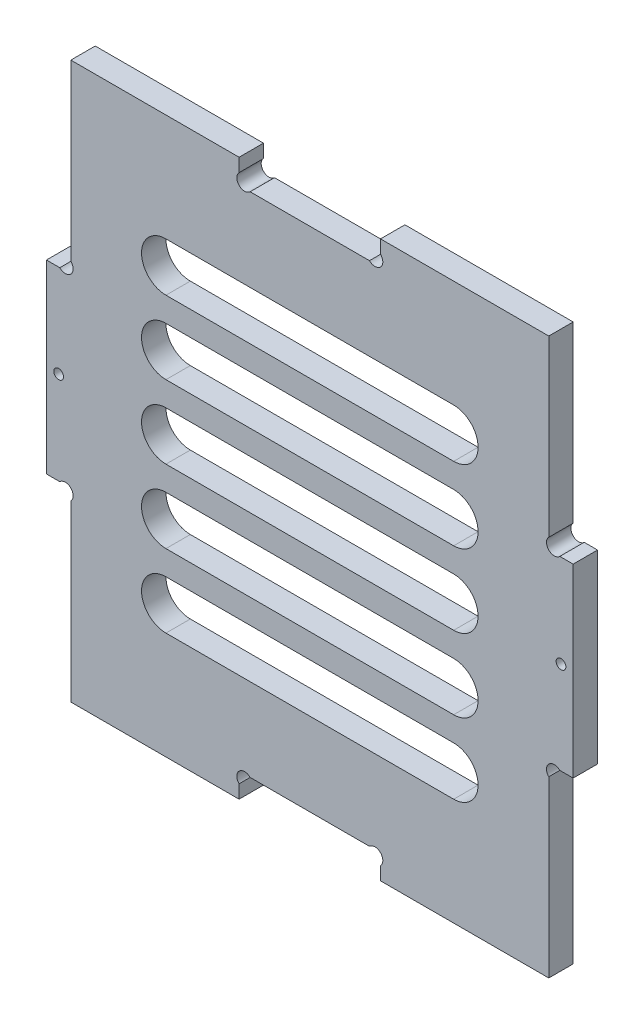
ISO-10303-21;
HEADER;
FILE_DESCRIPTION(('STEP AP214'),'2;1');
FILE_NAME('part.step','',(''),(''),'','','');
FILE_SCHEMA(('AUTOMOTIVE_DESIGN { 1 0 10303 214 1 1 1 1 }'));
ENDSEC;
DATA;
#1=APPLICATION_CONTEXT('core data for automotive mechanical design processes');
#2=APPLICATION_PROTOCOL_DEFINITION('international standard','automotive_design',2000,#1);
#3=PRODUCT_CONTEXT('',#1,'mechanical');
#4=PRODUCT('Part','Part','',(#3));
#5=PRODUCT_RELATED_PRODUCT_CATEGORY('part','',(#4));
#6=PRODUCT_DEFINITION_FORMATION('','',#4);
#7=PRODUCT_DEFINITION_CONTEXT('part definition',#1,'design');
#8=PRODUCT_DEFINITION('design','',#6,#7);
#9=PRODUCT_DEFINITION_SHAPE('','',#8);
#10=(LENGTH_UNIT() NAMED_UNIT(*) SI_UNIT(.MILLI.,.METRE.));
#11=(NAMED_UNIT(*) PLANE_ANGLE_UNIT() SI_UNIT($,.RADIAN.));
#12=(NAMED_UNIT(*) SI_UNIT($,.STERADIAN.) SOLID_ANGLE_UNIT());
#13=UNCERTAINTY_MEASURE_WITH_UNIT(LENGTH_MEASURE(1.E-05),#10,'distance_accuracy_value','');
#14=(GEOMETRIC_REPRESENTATION_CONTEXT(3) GLOBAL_UNCERTAINTY_ASSIGNED_CONTEXT((#13)) GLOBAL_UNIT_ASSIGNED_CONTEXT((#10,
#11,#12)) REPRESENTATION_CONTEXT('',''));
#15=CARTESIAN_POINT('',(0.,0.,0.));
#16=DIRECTION('',(0.,0.,1.));
#17=DIRECTION('',(1.,0.,0.));
#18=AXIS2_PLACEMENT_3D('',#15,#16,#17);
#19=CARTESIAN_POINT('',(71.877932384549,-42.2562324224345,5.));
#20=DIRECTION('',(0.,0.,1.));
#21=DIRECTION('',(1.,0.,0.));
#22=AXIS2_PLACEMENT_3D('',#19,#20,#21);
#23=PLANE('',#22);
#24=CARTESIAN_POINT('',(73.2465615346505,-22.124861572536,5.));
#25=DIRECTION('',(0.,0.,1.));
#26=DIRECTION('',(1.,0.,0.));
#27=AXIS2_PLACEMENT_3D('',#24,#25,#26);
#28=CIRCLE('',#27,0.999999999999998);
#29=CARTESIAN_POINT('',(74.2465615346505,-22.124861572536,5.));
#30=VERTEX_POINT('',#29);
#31=EDGE_CURVE('E366',#30,#30,#28,.T.);
#32=ORIENTED_EDGE('',*,*,#31,.F.);
#33=EDGE_LOOP('',(#32));
#34=FACE_BOUND('',#33,.T.);
#35=DIRECTION('',(-1.,0.,0.));
#36=VECTOR('',#35,1.);
#37=CARTESIAN_POINT('',(-7.75343846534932,-32.124861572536,5.));
#38=LINE('',#37,#36);
#39=CARTESIAN_POINT('',(51.2465615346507,-32.124861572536,5.));
#40=VERTEX_POINT('',#39);
#41=CARTESIAN_POINT('',(-7.75343846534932,-32.124861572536,5.));
#42=VERTEX_POINT('',#41);
#43=EDGE_CURVE('E378',#40,#42,#38,.T.);
#44=ORIENTED_EDGE('',*,*,#43,.F.);
#45=CARTESIAN_POINT('',(51.2465615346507,-37.124861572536,5.));
#46=DIRECTION('',(0.,0.,1.));
#47=DIRECTION('',(1.,0.,0.));
#48=AXIS2_PLACEMENT_3D('',#45,#46,#47);
#49=CIRCLE('',#48,5.);
#50=CARTESIAN_POINT('',(51.2465615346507,-42.124861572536,5.));
#51=VERTEX_POINT('',#50);
#52=EDGE_CURVE('E376',#51,#40,#49,.T.);
#53=ORIENTED_EDGE('',*,*,#52,.F.);
#54=DIRECTION('',(1.,0.,0.));
#55=VECTOR('',#54,1.);
#56=CARTESIAN_POINT('',(-7.75343846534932,-42.124861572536,5.));
#57=LINE('',#56,#55);
#58=CARTESIAN_POINT('',(-7.75343846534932,-42.124861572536,5.));
#59=VERTEX_POINT('',#58);
#60=EDGE_CURVE('E384',#59,#51,#57,.T.);
#61=ORIENTED_EDGE('',*,*,#60,.F.);
#62=CARTESIAN_POINT('',(-7.75343846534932,-37.124861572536,5.));
#63=DIRECTION('',(0.,0.,1.));
#64=DIRECTION('',(-1.,0.,0.));
#65=AXIS2_PLACEMENT_3D('',#62,#63,#64);
#66=CIRCLE('',#65,5.);
#67=EDGE_CURVE('E381',#42,#59,#66,.T.);
#68=ORIENTED_EDGE('',*,*,#67,.F.);
#69=EDGE_LOOP('',(#44,#53,#61,#68));
#70=FACE_BOUND('',#69,.T.);
#71=DIRECTION('',(-1.,0.,0.));
#72=VECTOR('',#71,1.);
#73=CARTESIAN_POINT('',(-7.75343846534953,-2.12486157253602,5.));
#74=LINE('',#73,#72);
#75=CARTESIAN_POINT('',(51.2465615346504,-2.12486157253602,5.));
#76=VERTEX_POINT('',#75);
#77=CARTESIAN_POINT('',(-7.75343846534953,-2.12486157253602,5.));
#78=VERTEX_POINT('',#77);
#79=EDGE_CURVE('E440',#76,#78,#74,.T.);
#80=ORIENTED_EDGE('',*,*,#79,.F.);
#81=CARTESIAN_POINT('',(51.2465615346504,-7.12486157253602,5.));
#82=DIRECTION('',(0.,0.,1.));
#83=DIRECTION('',(1.,0.,0.));
#84=AXIS2_PLACEMENT_3D('',#81,#82,#83);
#85=CIRCLE('',#84,5.);
#86=CARTESIAN_POINT('',(51.2465615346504,-12.124861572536,5.));
#87=VERTEX_POINT('',#86);
#88=EDGE_CURVE('E438',#87,#76,#85,.T.);
#89=ORIENTED_EDGE('',*,*,#88,.F.);
#90=DIRECTION('',(1.,0.,0.));
#91=VECTOR('',#90,1.);
#92=CARTESIAN_POINT('',(-7.75343846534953,-12.124861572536,5.));
#93=LINE('',#92,#91);
#94=CARTESIAN_POINT('',(-7.75343846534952,-12.124861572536,5.));
#95=VERTEX_POINT('',#94);
#96=EDGE_CURVE('E446',#95,#87,#93,.T.);
#97=ORIENTED_EDGE('',*,*,#96,.F.);
#98=CARTESIAN_POINT('',(-7.75343846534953,-7.12486157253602,5.));
#99=DIRECTION('',(0.,0.,1.));
#100=DIRECTION('',(-1.,0.,0.));
#101=AXIS2_PLACEMENT_3D('',#98,#99,#100);
#102=CIRCLE('',#101,5.);
#103=EDGE_CURVE('E443',#78,#95,#102,.T.);
#104=ORIENTED_EDGE('',*,*,#103,.F.);
#105=EDGE_LOOP('',(#80,#89,#97,#104));
#106=FACE_BOUND('',#105,.T.);
#107=CARTESIAN_POINT('',(71.877932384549,-42.2562324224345,5.));
#108=DIRECTION('',(0.,0.,-1.));
#109=DIRECTION('',(1.,0.,0.));
#110=AXIS2_PLACEMENT_3D('',#107,#108,#109);
#111=CIRCLE('',#110,1.60000000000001);
#112=CARTESIAN_POINT('',(70.7465615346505,-43.387603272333,5.));
#113=VERTEX_POINT('',#112);
#114=CARTESIAN_POINT('',(73.0093032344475,-41.124861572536,5.));
#115=VERTEX_POINT('',#114);
#116=EDGE_CURVE('E500',#113,#115,#111,.T.);
#117=ORIENTED_EDGE('',*,*,#116,.T.);
#118=DIRECTION('',(1.,0.,0.));
#119=VECTOR('',#118,1.);
#120=CARTESIAN_POINT('',(73.0093032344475,-41.124861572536,5.));
#121=LINE('',#120,#119);
#122=CARTESIAN_POINT('',(75.7465615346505,-41.124861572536,5.));
#123=VERTEX_POINT('',#122);
#124=EDGE_CURVE('E503',#115,#123,#121,.T.);
#125=ORIENTED_EDGE('',*,*,#124,.T.);
#126=DIRECTION('',(0.,1.,0.));
#127=VECTOR('',#126,1.);
#128=CARTESIAN_POINT('',(75.7465615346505,-3.12486157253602,5.));
#129=LINE('',#128,#127);
#130=CARTESIAN_POINT('',(75.7465615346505,-3.12486157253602,5.));
#131=VERTEX_POINT('',#130);
#132=EDGE_CURVE('E506',#123,#131,#129,.T.);
#133=ORIENTED_EDGE('',*,*,#132,.T.);
#134=DIRECTION('',(-1.,0.,0.));
#135=VECTOR('',#134,1.);
#136=CARTESIAN_POINT('',(73.0093032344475,-3.124861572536,5.));
#137=LINE('',#136,#135);
#138=CARTESIAN_POINT('',(73.0093032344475,-3.124861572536,5.));
#139=VERTEX_POINT('',#138);
#140=EDGE_CURVE('E508',#131,#139,#137,.T.);
#141=ORIENTED_EDGE('',*,*,#140,.T.);
#142=CARTESIAN_POINT('',(71.877932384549,-1.99349072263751,5.));
#143=DIRECTION('',(0.,0.,-1.));
#144=DIRECTION('',(-1.,0.,0.));
#145=AXIS2_PLACEMENT_3D('',#142,#143,#144);
#146=CIRCLE('',#145,1.60000000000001);
#147=CARTESIAN_POINT('',(70.7465615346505,-0.862119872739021,5.));
#148=VERTEX_POINT('',#147);
#149=EDGE_CURVE('E510',#139,#148,#146,.T.);
#150=ORIENTED_EDGE('',*,*,#149,.T.);
#151=DIRECTION('',(0.,1.,0.));
#152=VECTOR('',#151,1.);
#153=CARTESIAN_POINT('',(70.7465615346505,34.875138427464,5.));
#154=LINE('',#153,#152);
#155=CARTESIAN_POINT('',(70.7465615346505,34.875138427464,5.));
#156=VERTEX_POINT('',#155);
#157=EDGE_CURVE('E512',#148,#156,#154,.T.);
#158=ORIENTED_EDGE('',*,*,#157,.T.);
#159=DIRECTION('',(-1.,0.,0.));
#160=VECTOR('',#159,1.);
#161=CARTESIAN_POINT('',(36.2465615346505,34.875138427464,5.));
#162=LINE('',#161,#160);
#163=CARTESIAN_POINT('',(36.2465615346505,34.875138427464,5.));
#164=VERTEX_POINT('',#163);
#165=EDGE_CURVE('E514',#156,#164,#162,.T.);
#166=ORIENTED_EDGE('',*,*,#165,.T.);
#167=DIRECTION('',(0.,-1.,0.));
#168=VECTOR('',#167,1.);
#169=CARTESIAN_POINT('',(36.2465615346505,32.137880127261,5.));
#170=LINE('',#169,#168);
#171=CARTESIAN_POINT('',(36.2465615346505,32.137880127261,5.));
#172=VERTEX_POINT('',#171);
#173=EDGE_CURVE('E516',#164,#172,#170,.T.);
#174=ORIENTED_EDGE('',*,*,#173,.T.);
#175=CARTESIAN_POINT('',(35.115190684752,31.0065092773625,5.));
#176=DIRECTION('',(0.,0.,-1.));
#177=DIRECTION('',(-1.,0.,0.));
#178=AXIS2_PLACEMENT_3D('',#175,#176,#177);
#179=CIRCLE('',#178,1.59999999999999);
#180=CARTESIAN_POINT('',(33.9838198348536,29.875138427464,5.));
#181=VERTEX_POINT('',#180);
#182=EDGE_CURVE('E518',#172,#181,#179,.T.);
#183=ORIENTED_EDGE('',*,*,#182,.T.);
#184=DIRECTION('',(-1.,0.,0.));
#185=VECTOR('',#184,1.);
#186=CARTESIAN_POINT('',(9.50930323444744,29.875138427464,5.));
#187=LINE('',#186,#185);
#188=CARTESIAN_POINT('',(9.50930323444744,29.875138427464,5.));
#189=VERTEX_POINT('',#188);
#190=EDGE_CURVE('E520',#181,#189,#187,.T.);
#191=ORIENTED_EDGE('',*,*,#190,.T.);
#192=CARTESIAN_POINT('',(8.37793238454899,31.0065092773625,5.));
#193=DIRECTION('',(0.,0.,-1.));
#194=DIRECTION('',(1.,0.,0.));
#195=AXIS2_PLACEMENT_3D('',#192,#193,#194);
#196=CIRCLE('',#195,1.59999999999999);
#197=CARTESIAN_POINT('',(7.24656153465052,32.137880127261,5.));
#198=VERTEX_POINT('',#197);
#199=EDGE_CURVE('E522',#189,#198,#196,.T.);
#200=ORIENTED_EDGE('',*,*,#199,.T.);
#201=DIRECTION('',(0.,1.,0.));
#202=VECTOR('',#201,1.);
#203=CARTESIAN_POINT('',(7.24656153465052,32.137880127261,5.));
#204=LINE('',#203,#202);
#205=CARTESIAN_POINT('',(7.24656153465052,34.875138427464,5.));
#206=VERTEX_POINT('',#205);
#207=EDGE_CURVE('E524',#198,#206,#204,.T.);
#208=ORIENTED_EDGE('',*,*,#207,.T.);
#209=DIRECTION('',(-1.,0.,0.));
#210=VECTOR('',#209,1.);
#211=CARTESIAN_POINT('',(7.24656153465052,34.875138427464,5.));
#212=LINE('',#211,#210);
#213=CARTESIAN_POINT('',(-27.2534384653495,34.875138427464,5.));
#214=VERTEX_POINT('',#213);
#215=EDGE_CURVE('E526',#206,#214,#212,.T.);
#216=ORIENTED_EDGE('',*,*,#215,.T.);
#217=DIRECTION('',(0.,-1.,0.));
#218=VECTOR('',#217,1.);
#219=CARTESIAN_POINT('',(-27.2534384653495,34.875138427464,5.));
#220=LINE('',#219,#218);
#221=CARTESIAN_POINT('',(-27.2534384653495,-0.862119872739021,5.));
#222=VERTEX_POINT('',#221);
#223=EDGE_CURVE('E528',#214,#222,#220,.T.);
#224=ORIENTED_EDGE('',*,*,#223,.T.);
#225=CARTESIAN_POINT('',(-28.3848093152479,-1.99349072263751,5.));
#226=DIRECTION('',(0.,0.,-1.));
#227=DIRECTION('',(1.,0.,0.));
#228=AXIS2_PLACEMENT_3D('',#225,#226,#227);
#229=CIRCLE('',#228,1.60000000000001);
#230=CARTESIAN_POINT('',(-29.5161801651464,-3.124861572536,5.));
#231=VERTEX_POINT('',#230);
#232=EDGE_CURVE('E530',#222,#231,#229,.T.);
#233=ORIENTED_EDGE('',*,*,#232,.T.);
#234=DIRECTION('',(-1.,0.,0.));
#235=VECTOR('',#234,1.);
#236=CARTESIAN_POINT('',(-29.5161801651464,-3.124861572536,5.));
#237=LINE('',#236,#235);
#238=CARTESIAN_POINT('',(-32.2534384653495,-3.12486157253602,5.));
#239=VERTEX_POINT('',#238);
#240=EDGE_CURVE('E532',#231,#239,#237,.T.);
#241=ORIENTED_EDGE('',*,*,#240,.T.);
#242=DIRECTION('',(0.,-1.,0.));
#243=VECTOR('',#242,1.);
#244=CARTESIAN_POINT('',(-32.2534384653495,-41.124861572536,5.));
#245=LINE('',#244,#243);
#246=CARTESIAN_POINT('',(-32.2534384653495,-41.124861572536,5.));
#247=VERTEX_POINT('',#246);
#248=EDGE_CURVE('E534',#239,#247,#245,.T.);
#249=ORIENTED_EDGE('',*,*,#248,.T.);
#250=DIRECTION('',(1.,0.,0.));
#251=VECTOR('',#250,1.);
#252=CARTESIAN_POINT('',(-29.5161801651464,-41.124861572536,5.));
#253=LINE('',#252,#251);
#254=CARTESIAN_POINT('',(-29.5161801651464,-41.124861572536,5.));
#255=VERTEX_POINT('',#254);
#256=EDGE_CURVE('E536',#247,#255,#253,.T.);
#257=ORIENTED_EDGE('',*,*,#256,.T.);
#258=CARTESIAN_POINT('',(-28.3848093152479,-42.2562324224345,5.));
#259=DIRECTION('',(0.,0.,-1.));
#260=DIRECTION('',(-1.,0.,0.));
#261=AXIS2_PLACEMENT_3D('',#258,#259,#260);
#262=CIRCLE('',#261,1.60000000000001);
#263=CARTESIAN_POINT('',(-27.2534384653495,-43.387603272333,5.));
#264=VERTEX_POINT('',#263);
#265=EDGE_CURVE('E538',#255,#264,#262,.T.);
#266=ORIENTED_EDGE('',*,*,#265,.T.);
#267=DIRECTION('',(0.,-1.,0.));
#268=VECTOR('',#267,1.);
#269=CARTESIAN_POINT('',(-27.2534384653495,-79.124861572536,5.));
#270=LINE('',#269,#268);
#271=CARTESIAN_POINT('',(-27.2534384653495,-79.124861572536,5.));
#272=VERTEX_POINT('',#271);
#273=EDGE_CURVE('E540',#264,#272,#270,.T.);
#274=ORIENTED_EDGE('',*,*,#273,.T.);
#275=DIRECTION('',(1.,0.,0.));
#276=VECTOR('',#275,1.);
#277=CARTESIAN_POINT('',(7.24656153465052,-79.124861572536,5.));
#278=LINE('',#277,#276);
#279=CARTESIAN_POINT('',(7.24656153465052,-79.124861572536,5.));
#280=VERTEX_POINT('',#279);
#281=EDGE_CURVE('E542',#272,#280,#278,.T.);
#282=ORIENTED_EDGE('',*,*,#281,.T.);
#283=DIRECTION('',(0.,1.,0.));
#284=VECTOR('',#283,1.);
#285=CARTESIAN_POINT('',(7.24656153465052,-76.387603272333,5.));
#286=LINE('',#285,#284);
#287=CARTESIAN_POINT('',(7.24656153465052,-76.387603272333,5.));
#288=VERTEX_POINT('',#287);
#289=EDGE_CURVE('E544',#280,#288,#286,.T.);
#290=ORIENTED_EDGE('',*,*,#289,.T.);
#291=CARTESIAN_POINT('',(8.37793238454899,-75.2562324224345,5.));
#292=DIRECTION('',(0.,0.,-1.));
#293=DIRECTION('',(-1.,0.,0.));
#294=AXIS2_PLACEMENT_3D('',#291,#292,#293);
#295=CIRCLE('',#294,1.59999999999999);
#296=CARTESIAN_POINT('',(9.50930323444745,-74.124861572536,5.));
#297=VERTEX_POINT('',#296);
#298=EDGE_CURVE('E546',#288,#297,#295,.T.);
#299=ORIENTED_EDGE('',*,*,#298,.T.);
#300=DIRECTION('',(1.,0.,0.));
#301=VECTOR('',#300,1.);
#302=CARTESIAN_POINT('',(9.50930323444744,-74.124861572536,5.));
#303=LINE('',#302,#301);
#304=CARTESIAN_POINT('',(33.9838198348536,-74.124861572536,5.));
#305=VERTEX_POINT('',#304);
#306=EDGE_CURVE('E548',#297,#305,#303,.T.);
#307=ORIENTED_EDGE('',*,*,#306,.T.);
#308=CARTESIAN_POINT('',(35.115190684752,-75.2562324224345,5.));
#309=DIRECTION('',(0.,0.,-1.));
#310=DIRECTION('',(1.,0.,0.));
#311=AXIS2_PLACEMENT_3D('',#308,#309,#310);
#312=CIRCLE('',#311,1.59999999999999);
#313=CARTESIAN_POINT('',(36.2465615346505,-76.387603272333,5.));
#314=VERTEX_POINT('',#313);
#315=EDGE_CURVE('E550',#305,#314,#312,.T.);
#316=ORIENTED_EDGE('',*,*,#315,.T.);
#317=DIRECTION('',(0.,-1.,0.));
#318=VECTOR('',#317,1.);
#319=CARTESIAN_POINT('',(36.2465615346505,-76.387603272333,5.));
#320=LINE('',#319,#318);
#321=CARTESIAN_POINT('',(36.2465615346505,-79.124861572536,5.));
#322=VERTEX_POINT('',#321);
#323=EDGE_CURVE('E552',#314,#322,#320,.T.);
#324=ORIENTED_EDGE('',*,*,#323,.T.);
#325=DIRECTION('',(1.,0.,0.));
#326=VECTOR('',#325,1.);
#327=CARTESIAN_POINT('',(36.2465615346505,-79.124861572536,5.));
#328=LINE('',#327,#326);
#329=CARTESIAN_POINT('',(70.7465615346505,-79.124861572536,5.));
#330=VERTEX_POINT('',#329);
#331=EDGE_CURVE('E554',#322,#330,#328,.T.);
#332=ORIENTED_EDGE('',*,*,#331,.T.);
#333=DIRECTION('',(0.,1.,0.));
#334=VECTOR('',#333,1.);
#335=CARTESIAN_POINT('',(70.7465615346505,-79.124861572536,5.));
#336=LINE('',#335,#334);
#337=EDGE_CURVE('E556',#330,#113,#336,.T.);
#338=ORIENTED_EDGE('',*,*,#337,.T.);
#339=EDGE_LOOP('',(#117,#125,#133,#141,#150,#158,#166,#174,#183,#191,#200,#208,#216,#224,#233,
#241,#249,#257,#266,#274,#282,#290,#299,#307,#316,#324,#332,#338));
#340=FACE_BOUND('',#339,.T.);
#341=DIRECTION('',(-1.,0.,0.));
#342=VECTOR('',#341,1.);
#343=CARTESIAN_POINT('',(-7.75343846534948,-17.124861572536,5.));
#344=LINE('',#343,#342);
#345=CARTESIAN_POINT('',(51.2465615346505,-17.124861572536,5.));
#346=VERTEX_POINT('',#345);
#347=CARTESIAN_POINT('',(-7.75343846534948,-17.124861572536,5.));
#348=VERTEX_POINT('',#347);
#349=EDGE_CURVE('E471',#346,#348,#344,.T.);
#350=ORIENTED_EDGE('',*,*,#349,.F.);
#351=CARTESIAN_POINT('',(51.2465615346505,-22.124861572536,5.));
#352=DIRECTION('',(0.,0.,1.));
#353=DIRECTION('',(1.,0.,0.));
#354=AXIS2_PLACEMENT_3D('',#351,#352,#353);
#355=CIRCLE('',#354,5.);
#356=CARTESIAN_POINT('',(51.2465615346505,-27.124861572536,5.));
#357=VERTEX_POINT('',#356);
#358=EDGE_CURVE('E469',#357,#346,#355,.T.);
#359=ORIENTED_EDGE('',*,*,#358,.F.);
#360=DIRECTION('',(1.,0.,0.));
#361=VECTOR('',#360,1.);
#362=CARTESIAN_POINT('',(-7.75343846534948,-27.124861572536,5.));
#363=LINE('',#362,#361);
#364=CARTESIAN_POINT('',(-7.75343846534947,-27.124861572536,5.));
#365=VERTEX_POINT('',#364);
#366=EDGE_CURVE('E477',#365,#357,#363,.T.);
#367=ORIENTED_EDGE('',*,*,#366,.F.);
#368=CARTESIAN_POINT('',(-7.75343846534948,-22.124861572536,5.));
#369=DIRECTION('',(0.,0.,1.));
#370=DIRECTION('',(-1.,0.,0.));
#371=AXIS2_PLACEMENT_3D('',#368,#369,#370);
#372=CIRCLE('',#371,5.);
#373=EDGE_CURVE('E474',#348,#365,#372,.T.);
#374=ORIENTED_EDGE('',*,*,#373,.F.);
#375=EDGE_LOOP('',(#350,#359,#367,#374));
#376=FACE_BOUND('',#375,.T.);
#377=DIRECTION('',(-1.,0.,0.));
#378=VECTOR('',#377,1.);
#379=CARTESIAN_POINT('',(-7.75343846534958,12.875138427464,5.));
#380=LINE('',#379,#378);
#381=CARTESIAN_POINT('',(51.2465615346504,12.875138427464,5.));
#382=VERTEX_POINT('',#381);
#383=CARTESIAN_POINT('',(-7.75343846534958,12.875138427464,5.));
#384=VERTEX_POINT('',#383);
#385=EDGE_CURVE('E409',#382,#384,#380,.T.);
#386=ORIENTED_EDGE('',*,*,#385,.F.);
#387=CARTESIAN_POINT('',(51.2465615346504,7.87513842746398,5.));
#388=DIRECTION('',(0.,0.,1.));
#389=DIRECTION('',(1.,0.,0.));
#390=AXIS2_PLACEMENT_3D('',#387,#388,#389);
#391=CIRCLE('',#390,5.);
#392=CARTESIAN_POINT('',(51.2465615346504,2.87513842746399,5.));
#393=VERTEX_POINT('',#392);
#394=EDGE_CURVE('E407',#393,#382,#391,.T.);
#395=ORIENTED_EDGE('',*,*,#394,.F.);
#396=DIRECTION('',(1.,0.,0.));
#397=VECTOR('',#396,1.);
#398=CARTESIAN_POINT('',(-7.75343846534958,2.87513842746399,5.));
#399=LINE('',#398,#397);
#400=CARTESIAN_POINT('',(-7.75343846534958,2.87513842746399,5.));
#401=VERTEX_POINT('',#400);
#402=EDGE_CURVE('E415',#401,#393,#399,.T.);
#403=ORIENTED_EDGE('',*,*,#402,.F.);
#404=CARTESIAN_POINT('',(-7.75343846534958,7.87513842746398,5.));
#405=DIRECTION('',(0.,0.,1.));
#406=DIRECTION('',(-1.,0.,0.));
#407=AXIS2_PLACEMENT_3D('',#404,#405,#406);
#408=CIRCLE('',#407,5.);
#409=EDGE_CURVE('E412',#384,#401,#408,.T.);
#410=ORIENTED_EDGE('',*,*,#409,.F.);
#411=EDGE_LOOP('',(#386,#395,#403,#410));
#412=FACE_BOUND('',#411,.T.);
#413=DIRECTION('',(-1.,0.,0.));
#414=VECTOR('',#413,1.);
#415=CARTESIAN_POINT('',(-7.75343846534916,-47.124861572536,5.));
#416=LINE('',#415,#414);
#417=CARTESIAN_POINT('',(51.2465615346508,-47.124861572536,5.));
#418=VERTEX_POINT('',#417);
#419=CARTESIAN_POINT('',(-7.75343846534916,-47.124861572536,5.));
#420=VERTEX_POINT('',#419);
#421=EDGE_CURVE('E345',#418,#420,#416,.T.);
#422=ORIENTED_EDGE('',*,*,#421,.F.);
#423=CARTESIAN_POINT('',(51.2465615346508,-52.124861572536,5.));
#424=DIRECTION('',(0.,0.,1.));
#425=DIRECTION('',(1.,0.,0.));
#426=AXIS2_PLACEMENT_3D('',#423,#424,#425);
#427=CIRCLE('',#426,5.);
#428=CARTESIAN_POINT('',(51.2465615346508,-57.124861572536,5.));
#429=VERTEX_POINT('',#428);
#430=EDGE_CURVE('E337',#429,#418,#427,.T.);
#431=ORIENTED_EDGE('',*,*,#430,.F.);
#432=DIRECTION('',(1.,0.,0.));
#433=VECTOR('',#432,1.);
#434=CARTESIAN_POINT('',(-7.75343846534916,-57.124861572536,5.));
#435=LINE('',#434,#433);
#436=CARTESIAN_POINT('',(-7.75343846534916,-57.124861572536,5.));
#437=VERTEX_POINT('',#436);
#438=EDGE_CURVE('E360',#437,#429,#435,.T.);
#439=ORIENTED_EDGE('',*,*,#438,.F.);
#440=CARTESIAN_POINT('',(-7.75343846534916,-52.124861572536,5.));
#441=DIRECTION('',(0.,0.,1.));
#442=DIRECTION('',(-1.,0.,0.));
#443=AXIS2_PLACEMENT_3D('',#440,#441,#442);
#444=CIRCLE('',#443,5.);
#445=EDGE_CURVE('E358',#420,#437,#444,.T.);
#446=ORIENTED_EDGE('',*,*,#445,.F.);
#447=EDGE_LOOP('',(#422,#431,#439,#446));
#448=FACE_BOUND('',#447,.T.);
#449=CARTESIAN_POINT('',(-29.7534384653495,-22.124861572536,5.));
#450=DIRECTION('',(0.,0.,1.));
#451=DIRECTION('',(-1.,0.,0.));
#452=AXIS2_PLACEMENT_3D('',#449,#450,#451);
#453=CIRCLE('',#452,0.999999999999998);
#454=CARTESIAN_POINT('',(-30.7534384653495,-22.124861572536,5.));
#455=VERTEX_POINT('',#454);
#456=EDGE_CURVE('E1293',#455,#455,#453,.T.);
#457=ORIENTED_EDGE('',*,*,#456,.F.);
#458=EDGE_LOOP('',(#457));
#459=FACE_BOUND('',#458,.T.);
#460=ADVANCED_FACE('F32',(#34,#70,#106,#340,#376,#412,#448,#459),#23,.T.);
#461=CARTESIAN_POINT('',(71.877932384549,-42.2562324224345,0.));
#462=DIRECTION('',(0.,0.,1.));
#463=DIRECTION('',(1.,0.,0.));
#464=AXIS2_PLACEMENT_3D('',#461,#462,#463);
#465=PLANE('',#464);
#466=CARTESIAN_POINT('',(73.2465615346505,-22.124861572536,0.));
#467=DIRECTION('',(0.,0.,1.));
#468=DIRECTION('',(1.,0.,0.));
#469=AXIS2_PLACEMENT_3D('',#466,#467,#468);
#470=CIRCLE('',#469,0.999999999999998);
#471=CARTESIAN_POINT('',(74.2465615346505,-22.124861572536,0.));
#472=VERTEX_POINT('',#471);
#473=EDGE_CURVE('E1299',#472,#472,#470,.T.);
#474=ORIENTED_EDGE('',*,*,#473,.T.);
#475=EDGE_LOOP('',(#474));
#476=FACE_BOUND('',#475,.T.);
#477=CARTESIAN_POINT('',(51.2465615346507,-37.124861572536,0.));
#478=DIRECTION('',(0.,0.,1.));
#479=DIRECTION('',(1.,0.,0.));
#480=AXIS2_PLACEMENT_3D('',#477,#478,#479);
#481=CIRCLE('',#480,5.);
#482=CARTESIAN_POINT('',(51.2465615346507,-42.124861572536,0.));
#483=VERTEX_POINT('',#482);
#484=CARTESIAN_POINT('',(51.2465615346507,-32.124861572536,0.));
#485=VERTEX_POINT('',#484);
#486=EDGE_CURVE('E353',#483,#485,#481,.T.);
#487=ORIENTED_EDGE('',*,*,#486,.T.);
#488=DIRECTION('',(-1.,0.,0.));
#489=VECTOR('',#488,1.);
#490=CARTESIAN_POINT('',(-7.75343846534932,-32.124861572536,0.));
#491=LINE('',#490,#489);
#492=CARTESIAN_POINT('',(-7.75343846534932,-32.124861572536,0.));
#493=VERTEX_POINT('',#492);
#494=EDGE_CURVE('E389',#485,#493,#491,.T.);
#495=ORIENTED_EDGE('',*,*,#494,.T.);
#496=CARTESIAN_POINT('',(-7.75343846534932,-37.124861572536,0.));
#497=DIRECTION('',(0.,0.,1.));
#498=DIRECTION('',(-1.,0.,0.));
#499=AXIS2_PLACEMENT_3D('',#496,#497,#498);
#500=CIRCLE('',#499,5.);
#501=CARTESIAN_POINT('',(-7.75343846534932,-42.124861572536,0.));
#502=VERTEX_POINT('',#501);
#503=EDGE_CURVE('E392',#493,#502,#500,.T.);
#504=ORIENTED_EDGE('',*,*,#503,.T.);
#505=DIRECTION('',(1.,0.,0.));
#506=VECTOR('',#505,1.);
#507=CARTESIAN_POINT('',(-7.75343846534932,-42.124861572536,0.));
#508=LINE('',#507,#506);
#509=EDGE_CURVE('E379',#502,#483,#508,.T.);
#510=ORIENTED_EDGE('',*,*,#509,.T.);
#511=EDGE_LOOP('',(#487,#495,#504,#510));
#512=FACE_BOUND('',#511,.T.);
#513=CARTESIAN_POINT('',(51.2465615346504,-7.12486157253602,0.));
#514=DIRECTION('',(0.,0.,1.));
#515=DIRECTION('',(1.,0.,0.));
#516=AXIS2_PLACEMENT_3D('',#513,#514,#515);
#517=CIRCLE('',#516,5.);
#518=CARTESIAN_POINT('',(51.2465615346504,-12.124861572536,0.));
#519=VERTEX_POINT('',#518);
#520=CARTESIAN_POINT('',(51.2465615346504,-2.12486157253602,0.));
#521=VERTEX_POINT('',#520);
#522=EDGE_CURVE('E437',#519,#521,#517,.T.);
#523=ORIENTED_EDGE('',*,*,#522,.T.);
#524=DIRECTION('',(-1.,0.,0.));
#525=VECTOR('',#524,1.);
#526=CARTESIAN_POINT('',(-7.75343846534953,-2.12486157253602,0.));
#527=LINE('',#526,#525);
#528=CARTESIAN_POINT('',(-7.75343846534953,-2.12486157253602,0.));
#529=VERTEX_POINT('',#528);
#530=EDGE_CURVE('E451',#521,#529,#527,.T.);
#531=ORIENTED_EDGE('',*,*,#530,.T.);
#532=CARTESIAN_POINT('',(-7.75343846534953,-7.12486157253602,0.));
#533=DIRECTION('',(0.,0.,1.));
#534=DIRECTION('',(-1.,0.,0.));
#535=AXIS2_PLACEMENT_3D('',#532,#533,#534);
#536=CIRCLE('',#535,5.);
#537=CARTESIAN_POINT('',(-7.75343846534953,-12.124861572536,0.));
#538=VERTEX_POINT('',#537);
#539=EDGE_CURVE('E454',#529,#538,#536,.T.);
#540=ORIENTED_EDGE('',*,*,#539,.T.);
#541=DIRECTION('',(1.,0.,0.));
#542=VECTOR('',#541,1.);
#543=CARTESIAN_POINT('',(-7.75343846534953,-12.124861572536,0.));
#544=LINE('',#543,#542);
#545=EDGE_CURVE('E441',#538,#519,#544,.T.);
#546=ORIENTED_EDGE('',*,*,#545,.T.);
#547=EDGE_LOOP('',(#523,#531,#540,#546));
#548=FACE_BOUND('',#547,.T.);
#549=CARTESIAN_POINT('',(71.877932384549,-42.2562324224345,0.));
#550=DIRECTION('',(0.,0.,-1.));
#551=DIRECTION('',(1.,0.,0.));
#552=AXIS2_PLACEMENT_3D('',#549,#550,#551);
#553=CIRCLE('',#552,1.60000000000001);
#554=CARTESIAN_POINT('',(70.7465615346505,-43.387603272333,0.));
#555=VERTEX_POINT('',#554);
#556=CARTESIAN_POINT('',(73.0093032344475,-41.124861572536,0.));
#557=VERTEX_POINT('',#556);
#558=EDGE_CURVE('E499',#555,#557,#553,.T.);
#559=ORIENTED_EDGE('',*,*,#558,.F.);
#560=DIRECTION('',(0.,1.,0.));
#561=VECTOR('',#560,1.);
#562=CARTESIAN_POINT('',(70.7465615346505,-79.124861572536,0.));
#563=LINE('',#562,#561);
#564=CARTESIAN_POINT('',(70.7465615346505,-79.124861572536,0.));
#565=VERTEX_POINT('',#564);
#566=EDGE_CURVE('E504',#565,#555,#563,.T.);
#567=ORIENTED_EDGE('',*,*,#566,.F.);
#568=DIRECTION('',(1.,0.,0.));
#569=VECTOR('',#568,1.);
#570=CARTESIAN_POINT('',(36.2465615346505,-79.124861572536,0.));
#571=LINE('',#570,#569);
#572=CARTESIAN_POINT('',(36.2465615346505,-79.124861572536,0.));
#573=VERTEX_POINT('',#572);
#574=EDGE_CURVE('E611',#573,#565,#571,.T.);
#575=ORIENTED_EDGE('',*,*,#574,.F.);
#576=DIRECTION('',(0.,-1.,0.));
#577=VECTOR('',#576,1.);
#578=CARTESIAN_POINT('',(36.2465615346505,-76.387603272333,0.));
#579=LINE('',#578,#577);
#580=CARTESIAN_POINT('',(36.2465615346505,-76.387603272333,0.));
#581=VERTEX_POINT('',#580);
#582=EDGE_CURVE('E609',#581,#573,#579,.T.);
#583=ORIENTED_EDGE('',*,*,#582,.F.);
#584=CARTESIAN_POINT('',(35.115190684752,-75.2562324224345,0.));
#585=DIRECTION('',(0.,0.,-1.));
#586=DIRECTION('',(1.,0.,0.));
#587=AXIS2_PLACEMENT_3D('',#584,#585,#586);
#588=CIRCLE('',#587,1.59999999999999);
#589=CARTESIAN_POINT('',(33.9838198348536,-74.124861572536,0.));
#590=VERTEX_POINT('',#589);
#591=EDGE_CURVE('E607',#590,#581,#588,.T.);
#592=ORIENTED_EDGE('',*,*,#591,.F.);
#593=DIRECTION('',(1.,0.,0.));
#594=VECTOR('',#593,1.);
#595=CARTESIAN_POINT('',(9.50930323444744,-74.124861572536,0.));
#596=LINE('',#595,#594);
#597=CARTESIAN_POINT('',(9.50930323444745,-74.124861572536,0.));
#598=VERTEX_POINT('',#597);
#599=EDGE_CURVE('E605',#598,#590,#596,.T.);
#600=ORIENTED_EDGE('',*,*,#599,.F.);
#601=CARTESIAN_POINT('',(8.37793238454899,-75.2562324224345,0.));
#602=DIRECTION('',(0.,0.,-1.));
#603=DIRECTION('',(-1.,0.,0.));
#604=AXIS2_PLACEMENT_3D('',#601,#602,#603);
#605=CIRCLE('',#604,1.59999999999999);
#606=CARTESIAN_POINT('',(7.24656153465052,-76.387603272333,0.));
#607=VERTEX_POINT('',#606);
#608=EDGE_CURVE('E603',#607,#598,#605,.T.);
#609=ORIENTED_EDGE('',*,*,#608,.F.);
#610=DIRECTION('',(0.,1.,0.));
#611=VECTOR('',#610,1.);
#612=CARTESIAN_POINT('',(7.24656153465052,-76.387603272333,0.));
#613=LINE('',#612,#611);
#614=CARTESIAN_POINT('',(7.24656153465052,-79.124861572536,0.));
#615=VERTEX_POINT('',#614);
#616=EDGE_CURVE('E601',#615,#607,#613,.T.);
#617=ORIENTED_EDGE('',*,*,#616,.F.);
#618=DIRECTION('',(1.,0.,0.));
#619=VECTOR('',#618,1.);
#620=CARTESIAN_POINT('',(7.24656153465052,-79.124861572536,0.));
#621=LINE('',#620,#619);
#622=CARTESIAN_POINT('',(-27.2534384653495,-79.124861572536,0.));
#623=VERTEX_POINT('',#622);
#624=EDGE_CURVE('E599',#623,#615,#621,.T.);
#625=ORIENTED_EDGE('',*,*,#624,.F.);
#626=DIRECTION('',(0.,-1.,0.));
#627=VECTOR('',#626,1.);
#628=CARTESIAN_POINT('',(-27.2534384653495,-79.124861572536,0.));
#629=LINE('',#628,#627);
#630=CARTESIAN_POINT('',(-27.2534384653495,-43.387603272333,0.));
#631=VERTEX_POINT('',#630);
#632=EDGE_CURVE('E597',#631,#623,#629,.T.);
#633=ORIENTED_EDGE('',*,*,#632,.F.);
#634=CARTESIAN_POINT('',(-28.3848093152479,-42.2562324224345,0.));
#635=DIRECTION('',(0.,0.,-1.));
#636=DIRECTION('',(-1.,0.,0.));
#637=AXIS2_PLACEMENT_3D('',#634,#635,#636);
#638=CIRCLE('',#637,1.60000000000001);
#639=CARTESIAN_POINT('',(-29.5161801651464,-41.124861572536,0.));
#640=VERTEX_POINT('',#639);
#641=EDGE_CURVE('E595',#640,#631,#638,.T.);
#642=ORIENTED_EDGE('',*,*,#641,.F.);
#643=DIRECTION('',(1.,0.,0.));
#644=VECTOR('',#643,1.);
#645=CARTESIAN_POINT('',(-29.5161801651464,-41.124861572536,0.));
#646=LINE('',#645,#644);
#647=CARTESIAN_POINT('',(-32.2534384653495,-41.124861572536,0.));
#648=VERTEX_POINT('',#647);
#649=EDGE_CURVE('E593',#648,#640,#646,.T.);
#650=ORIENTED_EDGE('',*,*,#649,.F.);
#651=DIRECTION('',(0.,-1.,0.));
#652=VECTOR('',#651,1.);
#653=CARTESIAN_POINT('',(-32.2534384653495,-41.124861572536,0.));
#654=LINE('',#653,#652);
#655=CARTESIAN_POINT('',(-32.2534384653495,-3.12486157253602,0.));
#656=VERTEX_POINT('',#655);
#657=EDGE_CURVE('E591',#656,#648,#654,.T.);
#658=ORIENTED_EDGE('',*,*,#657,.F.);
#659=DIRECTION('',(-1.,0.,0.));
#660=VECTOR('',#659,1.);
#661=CARTESIAN_POINT('',(-29.5161801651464,-3.124861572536,0.));
#662=LINE('',#661,#660);
#663=CARTESIAN_POINT('',(-29.5161801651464,-3.124861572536,0.));
#664=VERTEX_POINT('',#663);
#665=EDGE_CURVE('E589',#664,#656,#662,.T.);
#666=ORIENTED_EDGE('',*,*,#665,.F.);
#667=CARTESIAN_POINT('',(-28.3848093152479,-1.99349072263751,0.));
#668=DIRECTION('',(0.,0.,-1.));
#669=DIRECTION('',(1.,0.,0.));
#670=AXIS2_PLACEMENT_3D('',#667,#668,#669);
#671=CIRCLE('',#670,1.60000000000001);
#672=CARTESIAN_POINT('',(-27.2534384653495,-0.862119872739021,0.));
#673=VERTEX_POINT('',#672);
#674=EDGE_CURVE('E587',#673,#664,#671,.T.);
#675=ORIENTED_EDGE('',*,*,#674,.F.);
#676=DIRECTION('',(0.,-1.,0.));
#677=VECTOR('',#676,1.);
#678=CARTESIAN_POINT('',(-27.2534384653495,34.875138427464,0.));
#679=LINE('',#678,#677);
#680=CARTESIAN_POINT('',(-27.2534384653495,34.875138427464,0.));
#681=VERTEX_POINT('',#680);
#682=EDGE_CURVE('E585',#681,#673,#679,.T.);
#683=ORIENTED_EDGE('',*,*,#682,.F.);
#684=DIRECTION('',(-1.,0.,0.));
#685=VECTOR('',#684,1.);
#686=CARTESIAN_POINT('',(7.24656153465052,34.875138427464,0.));
#687=LINE('',#686,#685);
#688=CARTESIAN_POINT('',(7.24656153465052,34.875138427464,0.));
#689=VERTEX_POINT('',#688);
#690=EDGE_CURVE('E583',#689,#681,#687,.T.);
#691=ORIENTED_EDGE('',*,*,#690,.F.);
#692=DIRECTION('',(0.,1.,0.));
#693=VECTOR('',#692,1.);
#694=CARTESIAN_POINT('',(7.24656153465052,32.137880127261,0.));
#695=LINE('',#694,#693);
#696=CARTESIAN_POINT('',(7.24656153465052,32.137880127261,0.));
#697=VERTEX_POINT('',#696);
#698=EDGE_CURVE('E581',#697,#689,#695,.T.);
#699=ORIENTED_EDGE('',*,*,#698,.F.);
#700=CARTESIAN_POINT('',(8.37793238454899,31.0065092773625,0.));
#701=DIRECTION('',(0.,0.,-1.));
#702=DIRECTION('',(1.,0.,0.));
#703=AXIS2_PLACEMENT_3D('',#700,#701,#702);
#704=CIRCLE('',#703,1.59999999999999);
#705=CARTESIAN_POINT('',(9.50930323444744,29.875138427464,0.));
#706=VERTEX_POINT('',#705);
#707=EDGE_CURVE('E579',#706,#697,#704,.T.);
#708=ORIENTED_EDGE('',*,*,#707,.F.);
#709=DIRECTION('',(-1.,0.,0.));
#710=VECTOR('',#709,1.);
#711=CARTESIAN_POINT('',(9.50930323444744,29.875138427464,0.));
#712=LINE('',#711,#710);
#713=CARTESIAN_POINT('',(33.9838198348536,29.875138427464,0.));
#714=VERTEX_POINT('',#713);
#715=EDGE_CURVE('E577',#714,#706,#712,.T.);
#716=ORIENTED_EDGE('',*,*,#715,.F.);
#717=CARTESIAN_POINT('',(35.115190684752,31.0065092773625,0.));
#718=DIRECTION('',(0.,0.,-1.));
#719=DIRECTION('',(-1.,0.,0.));
#720=AXIS2_PLACEMENT_3D('',#717,#718,#719);
#721=CIRCLE('',#720,1.59999999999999);
#722=CARTESIAN_POINT('',(36.2465615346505,32.137880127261,0.));
#723=VERTEX_POINT('',#722);
#724=EDGE_CURVE('E575',#723,#714,#721,.T.);
#725=ORIENTED_EDGE('',*,*,#724,.F.);
#726=DIRECTION('',(0.,-1.,0.));
#727=VECTOR('',#726,1.);
#728=CARTESIAN_POINT('',(36.2465615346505,32.137880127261,0.));
#729=LINE('',#728,#727);
#730=CARTESIAN_POINT('',(36.2465615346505,34.875138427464,0.));
#731=VERTEX_POINT('',#730);
#732=EDGE_CURVE('E573',#731,#723,#729,.T.);
#733=ORIENTED_EDGE('',*,*,#732,.F.);
#734=DIRECTION('',(-1.,0.,0.));
#735=VECTOR('',#734,1.);
#736=CARTESIAN_POINT('',(36.2465615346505,34.875138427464,0.));
#737=LINE('',#736,#735);
#738=CARTESIAN_POINT('',(70.7465615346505,34.875138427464,0.));
#739=VERTEX_POINT('',#738);
#740=EDGE_CURVE('E571',#739,#731,#737,.T.);
#741=ORIENTED_EDGE('',*,*,#740,.F.);
#742=DIRECTION('',(0.,1.,0.));
#743=VECTOR('',#742,1.);
#744=CARTESIAN_POINT('',(70.7465615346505,34.875138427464,0.));
#745=LINE('',#744,#743);
#746=CARTESIAN_POINT('',(70.7465615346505,-0.862119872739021,0.));
#747=VERTEX_POINT('',#746);
#748=EDGE_CURVE('E569',#747,#739,#745,.T.);
#749=ORIENTED_EDGE('',*,*,#748,.F.);
#750=CARTESIAN_POINT('',(71.877932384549,-1.99349072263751,0.));
#751=DIRECTION('',(0.,0.,-1.));
#752=DIRECTION('',(-1.,0.,0.));
#753=AXIS2_PLACEMENT_3D('',#750,#751,#752);
#754=CIRCLE('',#753,1.60000000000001);
#755=CARTESIAN_POINT('',(73.0093032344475,-3.124861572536,0.));
#756=VERTEX_POINT('',#755);
#757=EDGE_CURVE('E567',#756,#747,#754,.T.);
#758=ORIENTED_EDGE('',*,*,#757,.F.);
#759=DIRECTION('',(-1.,0.,0.));
#760=VECTOR('',#759,1.);
#761=CARTESIAN_POINT('',(73.0093032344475,-3.124861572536,0.));
#762=LINE('',#761,#760);
#763=CARTESIAN_POINT('',(75.7465615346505,-3.12486157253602,0.));
#764=VERTEX_POINT('',#763);
#765=EDGE_CURVE('E565',#764,#756,#762,.T.);
#766=ORIENTED_EDGE('',*,*,#765,.F.);
#767=DIRECTION('',(0.,1.,0.));
#768=VECTOR('',#767,1.);
#769=CARTESIAN_POINT('',(75.7465615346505,-3.12486157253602,0.));
#770=LINE('',#769,#768);
#771=CARTESIAN_POINT('',(75.7465615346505,-41.124861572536,0.));
#772=VERTEX_POINT('',#771);
#773=EDGE_CURVE('E563',#772,#764,#770,.T.);
#774=ORIENTED_EDGE('',*,*,#773,.F.);
#775=DIRECTION('',(1.,0.,0.));
#776=VECTOR('',#775,1.);
#777=CARTESIAN_POINT('',(73.0093032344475,-41.124861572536,0.));
#778=LINE('',#777,#776);
#779=EDGE_CURVE('E561',#557,#772,#778,.T.);
#780=ORIENTED_EDGE('',*,*,#779,.F.);
#781=EDGE_LOOP('',(#559,#567,#575,#583,#592,#600,#609,#617,#625,#633,#642,#650,#658,#666,#675,
#683,#691,#699,#708,#716,#725,#733,#741,#749,#758,#766,#774,#780));
#782=FACE_BOUND('',#781,.T.);
#783=CARTESIAN_POINT('',(51.2465615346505,-22.124861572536,0.));
#784=DIRECTION('',(0.,0.,1.));
#785=DIRECTION('',(1.,0.,0.));
#786=AXIS2_PLACEMENT_3D('',#783,#784,#785);
#787=CIRCLE('',#786,5.);
#788=CARTESIAN_POINT('',(51.2465615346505,-27.124861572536,0.));
#789=VERTEX_POINT('',#788);
#790=CARTESIAN_POINT('',(51.2465615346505,-17.124861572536,0.));
#791=VERTEX_POINT('',#790);
#792=EDGE_CURVE('E468',#789,#791,#787,.T.);
#793=ORIENTED_EDGE('',*,*,#792,.T.);
#794=DIRECTION('',(-1.,0.,0.));
#795=VECTOR('',#794,1.);
#796=CARTESIAN_POINT('',(-7.75343846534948,-17.124861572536,0.));
#797=LINE('',#796,#795);
#798=CARTESIAN_POINT('',(-7.75343846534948,-17.124861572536,0.));
#799=VERTEX_POINT('',#798);
#800=EDGE_CURVE('E482',#791,#799,#797,.T.);
#801=ORIENTED_EDGE('',*,*,#800,.T.);
#802=CARTESIAN_POINT('',(-7.75343846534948,-22.124861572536,0.));
#803=DIRECTION('',(0.,0.,1.));
#804=DIRECTION('',(-1.,0.,0.));
#805=AXIS2_PLACEMENT_3D('',#802,#803,#804);
#806=CIRCLE('',#805,5.);
#807=CARTESIAN_POINT('',(-7.75343846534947,-27.124861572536,0.));
#808=VERTEX_POINT('',#807);
#809=EDGE_CURVE('E485',#799,#808,#806,.T.);
#810=ORIENTED_EDGE('',*,*,#809,.T.);
#811=DIRECTION('',(1.,0.,0.));
#812=VECTOR('',#811,1.);
#813=CARTESIAN_POINT('',(-7.75343846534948,-27.124861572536,0.));
#814=LINE('',#813,#812);
#815=EDGE_CURVE('E472',#808,#789,#814,.T.);
#816=ORIENTED_EDGE('',*,*,#815,.T.);
#817=EDGE_LOOP('',(#793,#801,#810,#816));
#818=FACE_BOUND('',#817,.T.);
#819=CARTESIAN_POINT('',(51.2465615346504,7.87513842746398,0.));
#820=DIRECTION('',(0.,0.,1.));
#821=DIRECTION('',(1.,0.,0.));
#822=AXIS2_PLACEMENT_3D('',#819,#820,#821);
#823=CIRCLE('',#822,5.);
#824=CARTESIAN_POINT('',(51.2465615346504,2.87513842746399,0.));
#825=VERTEX_POINT('',#824);
#826=CARTESIAN_POINT('',(51.2465615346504,12.875138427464,0.));
#827=VERTEX_POINT('',#826);
#828=EDGE_CURVE('E406',#825,#827,#823,.T.);
#829=ORIENTED_EDGE('',*,*,#828,.T.);
#830=DIRECTION('',(-1.,0.,0.));
#831=VECTOR('',#830,1.);
#832=CARTESIAN_POINT('',(-7.75343846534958,12.875138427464,0.));
#833=LINE('',#832,#831);
#834=CARTESIAN_POINT('',(-7.75343846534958,12.875138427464,0.));
#835=VERTEX_POINT('',#834);
#836=EDGE_CURVE('E420',#827,#835,#833,.T.);
#837=ORIENTED_EDGE('',*,*,#836,.T.);
#838=CARTESIAN_POINT('',(-7.75343846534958,7.87513842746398,0.));
#839=DIRECTION('',(0.,0.,1.));
#840=DIRECTION('',(-1.,0.,0.));
#841=AXIS2_PLACEMENT_3D('',#838,#839,#840);
#842=CIRCLE('',#841,5.);
#843=CARTESIAN_POINT('',(-7.75343846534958,2.87513842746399,0.));
#844=VERTEX_POINT('',#843);
#845=EDGE_CURVE('E423',#835,#844,#842,.T.);
#846=ORIENTED_EDGE('',*,*,#845,.T.);
#847=DIRECTION('',(1.,0.,0.));
#848=VECTOR('',#847,1.);
#849=CARTESIAN_POINT('',(-7.75343846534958,2.87513842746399,0.));
#850=LINE('',#849,#848);
#851=EDGE_CURVE('E410',#844,#825,#850,.T.);
#852=ORIENTED_EDGE('',*,*,#851,.T.);
#853=EDGE_LOOP('',(#829,#837,#846,#852));
#854=FACE_BOUND('',#853,.T.);
#855=CARTESIAN_POINT('',(51.2465615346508,-52.124861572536,0.));
#856=DIRECTION('',(0.,0.,1.));
#857=DIRECTION('',(1.,0.,0.));
#858=AXIS2_PLACEMENT_3D('',#855,#856,#857);
#859=CIRCLE('',#858,5.);
#860=CARTESIAN_POINT('',(51.2465615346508,-57.124861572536,0.));
#861=VERTEX_POINT('',#860);
#862=CARTESIAN_POINT('',(51.2465615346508,-47.124861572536,0.));
#863=VERTEX_POINT('',#862);
#864=EDGE_CURVE('E55',#861,#863,#859,.T.);
#865=ORIENTED_EDGE('',*,*,#864,.T.);
#866=DIRECTION('',(-1.,0.,0.));
#867=VECTOR('',#866,1.);
#868=CARTESIAN_POINT('',(-7.75343846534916,-47.124861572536,0.));
#869=LINE('',#868,#867);
#870=CARTESIAN_POINT('',(-7.75343846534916,-47.124861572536,0.));
#871=VERTEX_POINT('',#870);
#872=EDGE_CURVE('E352',#863,#871,#869,.T.);
#873=ORIENTED_EDGE('',*,*,#872,.T.);
#874=CARTESIAN_POINT('',(-7.75343846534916,-52.124861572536,0.));
#875=DIRECTION('',(0.,0.,1.));
#876=DIRECTION('',(-1.,0.,0.));
#877=AXIS2_PLACEMENT_3D('',#874,#875,#876);
#878=CIRCLE('',#877,5.);
#879=CARTESIAN_POINT('',(-7.75343846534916,-57.124861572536,0.));
#880=VERTEX_POINT('',#879);
#881=EDGE_CURVE('E368',#871,#880,#878,.T.);
#882=ORIENTED_EDGE('',*,*,#881,.T.);
#883=DIRECTION('',(1.,0.,0.));
#884=VECTOR('',#883,1.);
#885=CARTESIAN_POINT('',(-7.75343846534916,-57.124861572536,0.));
#886=LINE('',#885,#884);
#887=EDGE_CURVE('E346',#880,#861,#886,.T.);
#888=ORIENTED_EDGE('',*,*,#887,.T.);
#889=EDGE_LOOP('',(#865,#873,#882,#888));
#890=FACE_BOUND('',#889,.T.);
#891=CARTESIAN_POINT('',(-29.7534384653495,-22.124861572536,0.));
#892=DIRECTION('',(0.,0.,1.));
#893=DIRECTION('',(-1.,0.,0.));
#894=AXIS2_PLACEMENT_3D('',#891,#892,#893);
#895=CIRCLE('',#894,0.999999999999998);
#896=CARTESIAN_POINT('',(-30.7534384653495,-22.124861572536,0.));
#897=VERTEX_POINT('',#896);
#898=EDGE_CURVE('E1296',#897,#897,#895,.T.);
#899=ORIENTED_EDGE('',*,*,#898,.T.);
#900=EDGE_LOOP('',(#899));
#901=FACE_BOUND('',#900,.T.);
#902=ADVANCED_FACE('F701',(#476,#512,#548,#782,#818,#854,#890,#901),#465,.F.);
#903=CARTESIAN_POINT('',(71.877932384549,-42.2562324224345,5.));
#904=DIRECTION('',(0.,0.,-1.));
#905=DIRECTION('',(-1.,0.,0.));
#906=AXIS2_PLACEMENT_3D('',#903,#904,#905);
#907=CYLINDRICAL_SURFACE('',#906,1.60000000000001);
#908=ORIENTED_EDGE('',*,*,#558,.T.);
#909=DIRECTION('',(0.,0.,-1.));
#910=VECTOR('',#909,1.);
#911=CARTESIAN_POINT('',(73.0093032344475,-41.124861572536,5.));
#912=LINE('',#911,#910);
#913=EDGE_CURVE('E11',#115,#557,#912,.T.);
#914=ORIENTED_EDGE('',*,*,#913,.F.);
#915=ORIENTED_EDGE('',*,*,#116,.F.);
#916=DIRECTION('',(0.,0.,-1.));
#917=VECTOR('',#916,1.);
#918=CARTESIAN_POINT('',(70.7465615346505,-43.387603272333,5.));
#919=LINE('',#918,#917);
#920=EDGE_CURVE('E558',#113,#555,#919,.T.);
#921=ORIENTED_EDGE('',*,*,#920,.T.);
#922=EDGE_LOOP('',(#908,#914,#915,#921));
#923=FACE_BOUND('',#922,.T.);
#924=ADVANCED_FACE('F34',(#923),#907,.F.);
#925=CARTESIAN_POINT('',(73.0093032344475,-41.124861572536,5.));
#926=DIRECTION('',(0.,1.,0.));
#927=DIRECTION('',(-1.,0.,0.));
#928=AXIS2_PLACEMENT_3D('',#925,#926,#927);
#929=PLANE('',#928);
#930=ORIENTED_EDGE('',*,*,#779,.T.);
#931=DIRECTION('',(0.,0.,-1.));
#932=VECTOR('',#931,1.);
#933=CARTESIAN_POINT('',(75.7465615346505,-41.124861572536,5.));
#934=LINE('',#933,#932);
#935=EDGE_CURVE('E40',#123,#772,#934,.T.);
#936=ORIENTED_EDGE('',*,*,#935,.F.);
#937=ORIENTED_EDGE('',*,*,#124,.F.);
#938=ORIENTED_EDGE('',*,*,#913,.T.);
#939=EDGE_LOOP('',(#930,#936,#937,#938));
#940=FACE_BOUND('',#939,.T.);
#941=ADVANCED_FACE('F719',(#940),#929,.F.);
#942=CARTESIAN_POINT('',(75.7465615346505,-3.12486157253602,5.));
#943=DIRECTION('',(-1.,0.,0.));
#944=DIRECTION('',(0.,0.,1.));
#945=AXIS2_PLACEMENT_3D('',#942,#943,#944);
#946=PLANE('',#945);
#947=ORIENTED_EDGE('',*,*,#773,.T.);
#948=DIRECTION('',(0.,0.,-1.));
#949=VECTOR('',#948,1.);
#950=CARTESIAN_POINT('',(75.7465615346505,-3.12486157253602,5.));
#951=LINE('',#950,#949);
#952=EDGE_CURVE('E688',#131,#764,#951,.T.);
#953=ORIENTED_EDGE('',*,*,#952,.F.);
#954=ORIENTED_EDGE('',*,*,#132,.F.);
#955=ORIENTED_EDGE('',*,*,#935,.T.);
#956=EDGE_LOOP('',(#947,#953,#954,#955));
#957=FACE_BOUND('',#956,.T.);
#958=ADVANCED_FACE('F695',(#957),#946,.F.);
#959=CARTESIAN_POINT('',(73.0093032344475,-3.124861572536,5.));
#960=DIRECTION('',(0.,-1.,0.));
#961=DIRECTION('',(1.,0.,0.));
#962=AXIS2_PLACEMENT_3D('',#959,#960,#961);
#963=PLANE('',#962);
#964=ORIENTED_EDGE('',*,*,#765,.T.);
#965=DIRECTION('',(0.,0.,-1.));
#966=VECTOR('',#965,1.);
#967=CARTESIAN_POINT('',(73.0093032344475,-3.124861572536,5.));
#968=LINE('',#967,#966);
#969=EDGE_CURVE('E685',#139,#756,#968,.T.);
#970=ORIENTED_EDGE('',*,*,#969,.F.);
#971=ORIENTED_EDGE('',*,*,#140,.F.);
#972=ORIENTED_EDGE('',*,*,#952,.T.);
#973=EDGE_LOOP('',(#964,#970,#971,#972));
#974=FACE_BOUND('',#973,.T.);
#975=ADVANCED_FACE('F707',(#974),#963,.F.);
#976=CARTESIAN_POINT('',(71.877932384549,-1.99349072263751,5.));
#977=DIRECTION('',(0.,0.,-1.));
#978=DIRECTION('',(-1.,0.,0.));
#979=AXIS2_PLACEMENT_3D('',#976,#977,#978);
#980=CYLINDRICAL_SURFACE('',#979,1.60000000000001);
#981=ORIENTED_EDGE('',*,*,#757,.T.);
#982=DIRECTION('',(0.,0.,-1.));
#983=VECTOR('',#982,1.);
#984=CARTESIAN_POINT('',(70.7465615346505,-0.862119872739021,5.));
#985=LINE('',#984,#983);
#986=EDGE_CURVE('E682',#148,#747,#985,.T.);
#987=ORIENTED_EDGE('',*,*,#986,.F.);
#988=ORIENTED_EDGE('',*,*,#149,.F.);
#989=ORIENTED_EDGE('',*,*,#969,.T.);
#990=EDGE_LOOP('',(#981,#987,#988,#989));
#991=FACE_BOUND('',#990,.T.);
#992=ADVANCED_FACE('F711',(#991),#980,.F.);
#993=CARTESIAN_POINT('',(70.7465615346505,34.875138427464,5.));
#994=DIRECTION('',(-1.,0.,0.));
#995=DIRECTION('',(0.,0.,1.));
#996=AXIS2_PLACEMENT_3D('',#993,#994,#995);
#997=PLANE('',#996);
#998=ORIENTED_EDGE('',*,*,#748,.T.);
#999=DIRECTION('',(0.,0.,-1.));
#1000=VECTOR('',#999,1.);
#1001=CARTESIAN_POINT('',(70.7465615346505,34.875138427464,5.));
#1002=LINE('',#1001,#1000);
#1003=EDGE_CURVE('E679',#156,#739,#1002,.T.);
#1004=ORIENTED_EDGE('',*,*,#1003,.F.);
#1005=ORIENTED_EDGE('',*,*,#157,.F.);
#1006=ORIENTED_EDGE('',*,*,#986,.T.);
#1007=EDGE_LOOP('',(#998,#1004,#1005,#1006));
#1008=FACE_BOUND('',#1007,.T.);
#1009=ADVANCED_FACE('F832',(#1008),#997,.F.);
#1010=CARTESIAN_POINT('',(36.2465615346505,34.875138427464,5.));
#1011=DIRECTION('',(0.,-1.,0.));
#1012=DIRECTION('',(1.,0.,0.));
#1013=AXIS2_PLACEMENT_3D('',#1010,#1011,#1012);
#1014=PLANE('',#1013);
#1015=ORIENTED_EDGE('',*,*,#740,.T.);
#1016=DIRECTION('',(0.,0.,-1.));
#1017=VECTOR('',#1016,1.);
#1018=CARTESIAN_POINT('',(36.2465615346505,34.875138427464,5.));
#1019=LINE('',#1018,#1017);
#1020=EDGE_CURVE('E676',#164,#731,#1019,.T.);
#1021=ORIENTED_EDGE('',*,*,#1020,.F.);
#1022=ORIENTED_EDGE('',*,*,#165,.F.);
#1023=ORIENTED_EDGE('',*,*,#1003,.T.);
#1024=EDGE_LOOP('',(#1015,#1021,#1022,#1023));
#1025=FACE_BOUND('',#1024,.T.);
#1026=ADVANCED_FACE('F829',(#1025),#1014,.F.);
#1027=CARTESIAN_POINT('',(36.2465615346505,32.137880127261,5.));
#1028=DIRECTION('',(1.,0.,0.));
#1029=DIRECTION('',(0.,1.,0.));
#1030=AXIS2_PLACEMENT_3D('',#1027,#1028,#1029);
#1031=PLANE('',#1030);
#1032=ORIENTED_EDGE('',*,*,#732,.T.);
#1033=DIRECTION('',(0.,0.,-1.));
#1034=VECTOR('',#1033,1.);
#1035=CARTESIAN_POINT('',(36.2465615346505,32.137880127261,5.));
#1036=LINE('',#1035,#1034);
#1037=EDGE_CURVE('E673',#172,#723,#1036,.T.);
#1038=ORIENTED_EDGE('',*,*,#1037,.F.);
#1039=ORIENTED_EDGE('',*,*,#173,.F.);
#1040=ORIENTED_EDGE('',*,*,#1020,.T.);
#1041=EDGE_LOOP('',(#1032,#1038,#1039,#1040));
#1042=FACE_BOUND('',#1041,.T.);
#1043=ADVANCED_FACE('F825',(#1042),#1031,.F.);
#1044=CARTESIAN_POINT('',(35.115190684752,31.0065092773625,5.));
#1045=DIRECTION('',(0.,0.,-1.));
#1046=DIRECTION('',(-1.,0.,0.));
#1047=AXIS2_PLACEMENT_3D('',#1044,#1045,#1046);
#1048=CYLINDRICAL_SURFACE('',#1047,1.59999999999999);
#1049=ORIENTED_EDGE('',*,*,#724,.T.);
#1050=DIRECTION('',(0.,0.,-1.));
#1051=VECTOR('',#1050,1.);
#1052=CARTESIAN_POINT('',(33.9838198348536,29.875138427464,5.));
#1053=LINE('',#1052,#1051);
#1054=EDGE_CURVE('E670',#181,#714,#1053,.T.);
#1055=ORIENTED_EDGE('',*,*,#1054,.F.);
#1056=ORIENTED_EDGE('',*,*,#182,.F.);
#1057=ORIENTED_EDGE('',*,*,#1037,.T.);
#1058=EDGE_LOOP('',(#1049,#1055,#1056,#1057));
#1059=FACE_BOUND('',#1058,.T.);
#1060=ADVANCED_FACE('F821',(#1059),#1048,.F.);
#1061=CARTESIAN_POINT('',(9.50930323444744,29.875138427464,5.));
#1062=DIRECTION('',(0.,-1.,0.));
#1063=DIRECTION('',(0.,0.,-1.));
#1064=AXIS2_PLACEMENT_3D('',#1061,#1062,#1063);
#1065=PLANE('',#1064);
#1066=ORIENTED_EDGE('',*,*,#715,.T.);
#1067=DIRECTION('',(0.,0.,-1.));
#1068=VECTOR('',#1067,1.);
#1069=CARTESIAN_POINT('',(9.50930323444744,29.875138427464,5.));
#1070=LINE('',#1069,#1068);
#1071=EDGE_CURVE('E667',#189,#706,#1070,.T.);
#1072=ORIENTED_EDGE('',*,*,#1071,.F.);
#1073=ORIENTED_EDGE('',*,*,#190,.F.);
#1074=ORIENTED_EDGE('',*,*,#1054,.T.);
#1075=EDGE_LOOP('',(#1066,#1072,#1073,#1074));
#1076=FACE_BOUND('',#1075,.T.);
#1077=ADVANCED_FACE('F816',(#1076),#1065,.F.);
#1078=CARTESIAN_POINT('',(8.37793238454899,31.0065092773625,5.));
#1079=DIRECTION('',(0.,0.,-1.));
#1080=DIRECTION('',(-1.,0.,0.));
#1081=AXIS2_PLACEMENT_3D('',#1078,#1079,#1080);
#1082=CYLINDRICAL_SURFACE('',#1081,1.59999999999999);
#1083=ORIENTED_EDGE('',*,*,#707,.T.);
#1084=DIRECTION('',(0.,0.,-1.));
#1085=VECTOR('',#1084,1.);
#1086=CARTESIAN_POINT('',(7.24656153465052,32.137880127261,5.));
#1087=LINE('',#1086,#1085);
#1088=EDGE_CURVE('E664',#198,#697,#1087,.T.);
#1089=ORIENTED_EDGE('',*,*,#1088,.F.);
#1090=ORIENTED_EDGE('',*,*,#199,.F.);
#1091=ORIENTED_EDGE('',*,*,#1071,.T.);
#1092=EDGE_LOOP('',(#1083,#1089,#1090,#1091));
#1093=FACE_BOUND('',#1092,.T.);
#1094=ADVANCED_FACE('F810',(#1093),#1082,.F.);
#1095=CARTESIAN_POINT('',(7.24656153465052,32.137880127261,5.));
#1096=DIRECTION('',(-1.,0.,0.));
#1097=DIRECTION('',(0.,-1.,0.));
#1098=AXIS2_PLACEMENT_3D('',#1095,#1096,#1097);
#1099=PLANE('',#1098);
#1100=ORIENTED_EDGE('',*,*,#698,.T.);
#1101=DIRECTION('',(0.,0.,-1.));
#1102=VECTOR('',#1101,1.);
#1103=CARTESIAN_POINT('',(7.24656153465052,34.875138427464,5.));
#1104=LINE('',#1103,#1102);
#1105=EDGE_CURVE('E661',#206,#689,#1104,.T.);
#1106=ORIENTED_EDGE('',*,*,#1105,.F.);
#1107=ORIENTED_EDGE('',*,*,#207,.F.);
#1108=ORIENTED_EDGE('',*,*,#1088,.T.);
#1109=EDGE_LOOP('',(#1100,#1106,#1107,#1108));
#1110=FACE_BOUND('',#1109,.T.);
#1111=ADVANCED_FACE('F806',(#1110),#1099,.F.);
#1112=CARTESIAN_POINT('',(7.24656153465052,34.875138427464,5.));
#1113=DIRECTION('',(0.,-1.,0.));
#1114=DIRECTION('',(1.,0.,0.));
#1115=AXIS2_PLACEMENT_3D('',#1112,#1113,#1114);
#1116=PLANE('',#1115);
#1117=ORIENTED_EDGE('',*,*,#690,.T.);
#1118=DIRECTION('',(0.,0.,-1.));
#1119=VECTOR('',#1118,1.);
#1120=CARTESIAN_POINT('',(-27.2534384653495,34.875138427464,5.));
#1121=LINE('',#1120,#1119);
#1122=EDGE_CURVE('E658',#214,#681,#1121,.T.);
#1123=ORIENTED_EDGE('',*,*,#1122,.F.);
#1124=ORIENTED_EDGE('',*,*,#215,.F.);
#1125=ORIENTED_EDGE('',*,*,#1105,.T.);
#1126=EDGE_LOOP('',(#1117,#1123,#1124,#1125));
#1127=FACE_BOUND('',#1126,.T.);
#1128=ADVANCED_FACE('F801',(#1127),#1116,.F.);
#1129=CARTESIAN_POINT('',(-27.2534384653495,34.875138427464,5.));
#1130=DIRECTION('',(1.,0.,0.));
#1131=DIRECTION('',(0.,0.,-1.));
#1132=AXIS2_PLACEMENT_3D('',#1129,#1130,#1131);
#1133=PLANE('',#1132);
#1134=ORIENTED_EDGE('',*,*,#682,.T.);
#1135=DIRECTION('',(0.,0.,-1.));
#1136=VECTOR('',#1135,1.);
#1137=CARTESIAN_POINT('',(-27.2534384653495,-0.862119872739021,5.));
#1138=LINE('',#1137,#1136);
#1139=EDGE_CURVE('E655',#222,#673,#1138,.T.);
#1140=ORIENTED_EDGE('',*,*,#1139,.F.);
#1141=ORIENTED_EDGE('',*,*,#223,.F.);
#1142=ORIENTED_EDGE('',*,*,#1122,.T.);
#1143=EDGE_LOOP('',(#1134,#1140,#1141,#1142));
#1144=FACE_BOUND('',#1143,.T.);
#1145=ADVANCED_FACE('F795',(#1144),#1133,.F.);
#1146=CARTESIAN_POINT('',(-28.3848093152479,-1.99349072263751,5.));
#1147=DIRECTION('',(0.,0.,-1.));
#1148=DIRECTION('',(-1.,0.,0.));
#1149=AXIS2_PLACEMENT_3D('',#1146,#1147,#1148);
#1150=CYLINDRICAL_SURFACE('',#1149,1.60000000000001);
#1151=ORIENTED_EDGE('',*,*,#674,.T.);
#1152=DIRECTION('',(0.,0.,-1.));
#1153=VECTOR('',#1152,1.);
#1154=CARTESIAN_POINT('',(-29.5161801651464,-3.124861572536,5.));
#1155=LINE('',#1154,#1153);
#1156=EDGE_CURVE('E652',#231,#664,#1155,.T.);
#1157=ORIENTED_EDGE('',*,*,#1156,.F.);
#1158=ORIENTED_EDGE('',*,*,#232,.F.);
#1159=ORIENTED_EDGE('',*,*,#1139,.T.);
#1160=EDGE_LOOP('',(#1151,#1157,#1158,#1159));
#1161=FACE_BOUND('',#1160,.T.);
#1162=ADVANCED_FACE('F791',(#1161),#1150,.F.);
#1163=CARTESIAN_POINT('',(-29.5161801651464,-3.124861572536,5.));
#1164=DIRECTION('',(0.,-1.,0.));
#1165=DIRECTION('',(1.,0.,0.));
#1166=AXIS2_PLACEMENT_3D('',#1163,#1164,#1165);
#1167=PLANE('',#1166);
#1168=ORIENTED_EDGE('',*,*,#665,.T.);
#1169=DIRECTION('',(0.,0.,-1.));
#1170=VECTOR('',#1169,1.);
#1171=CARTESIAN_POINT('',(-32.2534384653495,-3.12486157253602,5.));
#1172=LINE('',#1171,#1170);
#1173=EDGE_CURVE('E649',#239,#656,#1172,.T.);
#1174=ORIENTED_EDGE('',*,*,#1173,.F.);
#1175=ORIENTED_EDGE('',*,*,#240,.F.);
#1176=ORIENTED_EDGE('',*,*,#1156,.T.);
#1177=EDGE_LOOP('',(#1168,#1174,#1175,#1176));
#1178=FACE_BOUND('',#1177,.T.);
#1179=ADVANCED_FACE('F786',(#1178),#1167,.F.);
#1180=CARTESIAN_POINT('',(-32.2534384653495,-41.124861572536,5.));
#1181=DIRECTION('',(1.,0.,0.));
#1182=DIRECTION('',(0.,0.,-1.));
#1183=AXIS2_PLACEMENT_3D('',#1180,#1181,#1182);
#1184=PLANE('',#1183);
#1185=ORIENTED_EDGE('',*,*,#657,.T.);
#1186=DIRECTION('',(0.,0.,-1.));
#1187=VECTOR('',#1186,1.);
#1188=CARTESIAN_POINT('',(-32.2534384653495,-41.124861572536,5.));
#1189=LINE('',#1188,#1187);
#1190=EDGE_CURVE('E646',#247,#648,#1189,.T.);
#1191=ORIENTED_EDGE('',*,*,#1190,.F.);
#1192=ORIENTED_EDGE('',*,*,#248,.F.);
#1193=ORIENTED_EDGE('',*,*,#1173,.T.);
#1194=EDGE_LOOP('',(#1185,#1191,#1192,#1193));
#1195=FACE_BOUND('',#1194,.T.);
#1196=ADVANCED_FACE('F780',(#1195),#1184,.F.);
#1197=CARTESIAN_POINT('',(-29.5161801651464,-41.124861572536,5.));
#1198=DIRECTION('',(0.,1.,0.));
#1199=DIRECTION('',(-1.,0.,0.));
#1200=AXIS2_PLACEMENT_3D('',#1197,#1198,#1199);
#1201=PLANE('',#1200);
#1202=ORIENTED_EDGE('',*,*,#649,.T.);
#1203=DIRECTION('',(0.,0.,-1.));
#1204=VECTOR('',#1203,1.);
#1205=CARTESIAN_POINT('',(-29.5161801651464,-41.124861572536,5.));
#1206=LINE('',#1205,#1204);
#1207=EDGE_CURVE('E643',#255,#640,#1206,.T.);
#1208=ORIENTED_EDGE('',*,*,#1207,.F.);
#1209=ORIENTED_EDGE('',*,*,#256,.F.);
#1210=ORIENTED_EDGE('',*,*,#1190,.T.);
#1211=EDGE_LOOP('',(#1202,#1208,#1209,#1210));
#1212=FACE_BOUND('',#1211,.T.);
#1213=ADVANCED_FACE('F776',(#1212),#1201,.F.);
#1214=CARTESIAN_POINT('',(-28.3848093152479,-42.2562324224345,5.));
#1215=DIRECTION('',(0.,0.,-1.));
#1216=DIRECTION('',(-1.,0.,0.));
#1217=AXIS2_PLACEMENT_3D('',#1214,#1215,#1216);
#1218=CYLINDRICAL_SURFACE('',#1217,1.60000000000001);
#1219=ORIENTED_EDGE('',*,*,#641,.T.);
#1220=DIRECTION('',(0.,0.,-1.));
#1221=VECTOR('',#1220,1.);
#1222=CARTESIAN_POINT('',(-27.2534384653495,-43.387603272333,5.));
#1223=LINE('',#1222,#1221);
#1224=EDGE_CURVE('E640',#264,#631,#1223,.T.);
#1225=ORIENTED_EDGE('',*,*,#1224,.F.);
#1226=ORIENTED_EDGE('',*,*,#265,.F.);
#1227=ORIENTED_EDGE('',*,*,#1207,.T.);
#1228=EDGE_LOOP('',(#1219,#1225,#1226,#1227));
#1229=FACE_BOUND('',#1228,.T.);
#1230=ADVANCED_FACE('F771',(#1229),#1218,.F.);
#1231=CARTESIAN_POINT('',(-27.2534384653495,-79.124861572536,5.));
#1232=DIRECTION('',(1.,0.,0.));
#1233=DIRECTION('',(0.,0.,-1.));
#1234=AXIS2_PLACEMENT_3D('',#1231,#1232,#1233);
#1235=PLANE('',#1234);
#1236=ORIENTED_EDGE('',*,*,#632,.T.);
#1237=DIRECTION('',(0.,0.,-1.));
#1238=VECTOR('',#1237,1.);
#1239=CARTESIAN_POINT('',(-27.2534384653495,-79.124861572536,5.));
#1240=LINE('',#1239,#1238);
#1241=EDGE_CURVE('E637',#272,#623,#1240,.T.);
#1242=ORIENTED_EDGE('',*,*,#1241,.F.);
#1243=ORIENTED_EDGE('',*,*,#273,.F.);
#1244=ORIENTED_EDGE('',*,*,#1224,.T.);
#1245=EDGE_LOOP('',(#1236,#1242,#1243,#1244));
#1246=FACE_BOUND('',#1245,.T.);
#1247=ADVANCED_FACE('F765',(#1246),#1235,.F.);
#1248=CARTESIAN_POINT('',(7.24656153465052,-79.124861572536,5.));
#1249=DIRECTION('',(0.,1.,0.));
#1250=DIRECTION('',(-1.,0.,0.));
#1251=AXIS2_PLACEMENT_3D('',#1248,#1249,#1250);
#1252=PLANE('',#1251);
#1253=ORIENTED_EDGE('',*,*,#624,.T.);
#1254=DIRECTION('',(0.,0.,-1.));
#1255=VECTOR('',#1254,1.);
#1256=CARTESIAN_POINT('',(7.24656153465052,-79.124861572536,5.));
#1257=LINE('',#1256,#1255);
#1258=EDGE_CURVE('E634',#280,#615,#1257,.T.);
#1259=ORIENTED_EDGE('',*,*,#1258,.F.);
#1260=ORIENTED_EDGE('',*,*,#281,.F.);
#1261=ORIENTED_EDGE('',*,*,#1241,.T.);
#1262=EDGE_LOOP('',(#1253,#1259,#1260,#1261));
#1263=FACE_BOUND('',#1262,.T.);
#1264=ADVANCED_FACE('F761',(#1263),#1252,.F.);
#1265=CARTESIAN_POINT('',(7.24656153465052,-76.387603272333,5.));
#1266=DIRECTION('',(-1.,0.,0.));
#1267=DIRECTION('',(0.,-1.,0.));
#1268=AXIS2_PLACEMENT_3D('',#1265,#1266,#1267);
#1269=PLANE('',#1268);
#1270=ORIENTED_EDGE('',*,*,#616,.T.);
#1271=DIRECTION('',(0.,0.,-1.));
#1272=VECTOR('',#1271,1.);
#1273=CARTESIAN_POINT('',(7.24656153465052,-76.387603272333,5.));
#1274=LINE('',#1273,#1272);
#1275=EDGE_CURVE('E631',#288,#607,#1274,.T.);
#1276=ORIENTED_EDGE('',*,*,#1275,.F.);
#1277=ORIENTED_EDGE('',*,*,#289,.F.);
#1278=ORIENTED_EDGE('',*,*,#1258,.T.);
#1279=EDGE_LOOP('',(#1270,#1276,#1277,#1278));
#1280=FACE_BOUND('',#1279,.T.);
#1281=ADVANCED_FACE('F756',(#1280),#1269,.F.);
#1282=CARTESIAN_POINT('',(8.37793238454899,-75.2562324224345,5.));
#1283=DIRECTION('',(0.,0.,-1.));
#1284=DIRECTION('',(-1.,0.,0.));
#1285=AXIS2_PLACEMENT_3D('',#1282,#1283,#1284);
#1286=CYLINDRICAL_SURFACE('',#1285,1.59999999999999);
#1287=ORIENTED_EDGE('',*,*,#608,.T.);
#1288=DIRECTION('',(0.,0.,-1.));
#1289=VECTOR('',#1288,1.);
#1290=CARTESIAN_POINT('',(9.50930323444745,-74.124861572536,5.));
#1291=LINE('',#1290,#1289);
#1292=EDGE_CURVE('E628',#297,#598,#1291,.T.);
#1293=ORIENTED_EDGE('',*,*,#1292,.F.);
#1294=ORIENTED_EDGE('',*,*,#298,.F.);
#1295=ORIENTED_EDGE('',*,*,#1275,.T.);
#1296=EDGE_LOOP('',(#1287,#1293,#1294,#1295));
#1297=FACE_BOUND('',#1296,.T.);
#1298=ADVANCED_FACE('F750',(#1297),#1286,.F.);
#1299=CARTESIAN_POINT('',(9.50930323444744,-74.124861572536,5.));
#1300=DIRECTION('',(0.,1.,0.));
#1301=DIRECTION('',(0.,0.,1.));
#1302=AXIS2_PLACEMENT_3D('',#1299,#1300,#1301);
#1303=PLANE('',#1302);
#1304=ORIENTED_EDGE('',*,*,#599,.T.);
#1305=DIRECTION('',(0.,0.,-1.));
#1306=VECTOR('',#1305,1.);
#1307=CARTESIAN_POINT('',(33.9838198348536,-74.124861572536,5.));
#1308=LINE('',#1307,#1306);
#1309=EDGE_CURVE('E625',#305,#590,#1308,.T.);
#1310=ORIENTED_EDGE('',*,*,#1309,.F.);
#1311=ORIENTED_EDGE('',*,*,#306,.F.);
#1312=ORIENTED_EDGE('',*,*,#1292,.T.);
#1313=EDGE_LOOP('',(#1304,#1310,#1311,#1312));
#1314=FACE_BOUND('',#1313,.T.);
#1315=ADVANCED_FACE('F746',(#1314),#1303,.F.);
#1316=CARTESIAN_POINT('',(35.115190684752,-75.2562324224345,5.));
#1317=DIRECTION('',(0.,0.,-1.));
#1318=DIRECTION('',(-1.,0.,0.));
#1319=AXIS2_PLACEMENT_3D('',#1316,#1317,#1318);
#1320=CYLINDRICAL_SURFACE('',#1319,1.59999999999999);
#1321=ORIENTED_EDGE('',*,*,#591,.T.);
#1322=DIRECTION('',(0.,0.,-1.));
#1323=VECTOR('',#1322,1.);
#1324=CARTESIAN_POINT('',(36.2465615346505,-76.387603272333,5.));
#1325=LINE('',#1324,#1323);
#1326=EDGE_CURVE('E622',#314,#581,#1325,.T.);
#1327=ORIENTED_EDGE('',*,*,#1326,.F.);
#1328=ORIENTED_EDGE('',*,*,#315,.F.);
#1329=ORIENTED_EDGE('',*,*,#1309,.T.);
#1330=EDGE_LOOP('',(#1321,#1327,#1328,#1329));
#1331=FACE_BOUND('',#1330,.T.);
#1332=ADVANCED_FACE('F741',(#1331),#1320,.F.);
#1333=CARTESIAN_POINT('',(36.2465615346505,-76.387603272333,5.));
#1334=DIRECTION('',(1.,0.,0.));
#1335=DIRECTION('',(0.,1.,0.));
#1336=AXIS2_PLACEMENT_3D('',#1333,#1334,#1335);
#1337=PLANE('',#1336);
#1338=ORIENTED_EDGE('',*,*,#582,.T.);
#1339=DIRECTION('',(0.,0.,-1.));
#1340=VECTOR('',#1339,1.);
#1341=CARTESIAN_POINT('',(36.2465615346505,-79.124861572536,5.));
#1342=LINE('',#1341,#1340);
#1343=EDGE_CURVE('E619',#322,#573,#1342,.T.);
#1344=ORIENTED_EDGE('',*,*,#1343,.F.);
#1345=ORIENTED_EDGE('',*,*,#323,.F.);
#1346=ORIENTED_EDGE('',*,*,#1326,.T.);
#1347=EDGE_LOOP('',(#1338,#1344,#1345,#1346));
#1348=FACE_BOUND('',#1347,.T.);
#1349=ADVANCED_FACE('F735',(#1348),#1337,.F.);
#1350=CARTESIAN_POINT('',(36.2465615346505,-79.124861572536,5.));
#1351=DIRECTION('',(0.,1.,0.));
#1352=DIRECTION('',(-1.,0.,0.));
#1353=AXIS2_PLACEMENT_3D('',#1350,#1351,#1352);
#1354=PLANE('',#1353);
#1355=ORIENTED_EDGE('',*,*,#574,.T.);
#1356=DIRECTION('',(0.,0.,-1.));
#1357=VECTOR('',#1356,1.);
#1358=CARTESIAN_POINT('',(70.7465615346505,-79.124861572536,5.));
#1359=LINE('',#1358,#1357);
#1360=EDGE_CURVE('E616',#330,#565,#1359,.T.);
#1361=ORIENTED_EDGE('',*,*,#1360,.F.);
#1362=ORIENTED_EDGE('',*,*,#331,.F.);
#1363=ORIENTED_EDGE('',*,*,#1343,.T.);
#1364=EDGE_LOOP('',(#1355,#1361,#1362,#1363));
#1365=FACE_BOUND('',#1364,.T.);
#1366=ADVANCED_FACE('F731',(#1365),#1354,.F.);
#1367=CARTESIAN_POINT('',(70.7465615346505,-79.124861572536,5.));
#1368=DIRECTION('',(-1.,0.,0.));
#1369=DIRECTION('',(0.,0.,1.));
#1370=AXIS2_PLACEMENT_3D('',#1367,#1368,#1369);
#1371=PLANE('',#1370);
#1372=ORIENTED_EDGE('',*,*,#566,.T.);
#1373=ORIENTED_EDGE('',*,*,#920,.F.);
#1374=ORIENTED_EDGE('',*,*,#337,.F.);
#1375=ORIENTED_EDGE('',*,*,#1360,.T.);
#1376=EDGE_LOOP('',(#1372,#1373,#1374,#1375));
#1377=FACE_BOUND('',#1376,.T.);
#1378=ADVANCED_FACE('F726',(#1377),#1371,.F.);
#1379=CARTESIAN_POINT('',(51.2465615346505,-22.124861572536,5.));
#1380=DIRECTION('',(0.,0.,-1.));
#1381=DIRECTION('',(-1.,0.,0.));
#1382=AXIS2_PLACEMENT_3D('',#1379,#1380,#1381);
#1383=CYLINDRICAL_SURFACE('',#1382,5.);
#1384=ORIENTED_EDGE('',*,*,#792,.F.);
#1385=DIRECTION('',(0.,0.,-1.));
#1386=VECTOR('',#1385,1.);
#1387=CARTESIAN_POINT('',(51.2465615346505,-27.124861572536,5.));
#1388=LINE('',#1387,#1386);
#1389=EDGE_CURVE('E479',#357,#789,#1388,.T.);
#1390=ORIENTED_EDGE('',*,*,#1389,.F.);
#1391=ORIENTED_EDGE('',*,*,#358,.T.);
#1392=DIRECTION('',(0.,0.,-1.));
#1393=VECTOR('',#1392,1.);
#1394=CARTESIAN_POINT('',(51.2465615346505,-17.124861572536,5.));
#1395=LINE('',#1394,#1393);
#1396=EDGE_CURVE('E496',#346,#791,#1395,.T.);
#1397=ORIENTED_EDGE('',*,*,#1396,.T.);
#1398=EDGE_LOOP('',(#1384,#1390,#1391,#1397));
#1399=FACE_BOUND('',#1398,.T.);
#1400=ADVANCED_FACE('F852',(#1399),#1383,.F.);
#1401=CARTESIAN_POINT('',(-7.75343846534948,-17.124861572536,5.));
#1402=DIRECTION('',(0.,-1.,0.));
#1403=DIRECTION('',(0.,0.,-1.));
#1404=AXIS2_PLACEMENT_3D('',#1401,#1402,#1403);
#1405=PLANE('',#1404);
#1406=ORIENTED_EDGE('',*,*,#800,.F.);
#1407=ORIENTED_EDGE('',*,*,#1396,.F.);
#1408=ORIENTED_EDGE('',*,*,#349,.T.);
#1409=DIRECTION('',(0.,0.,-1.));
#1410=VECTOR('',#1409,1.);
#1411=CARTESIAN_POINT('',(-7.75343846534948,-17.124861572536,5.));
#1412=LINE('',#1411,#1410);
#1413=EDGE_CURVE('E494',#348,#799,#1412,.T.);
#1414=ORIENTED_EDGE('',*,*,#1413,.T.);
#1415=EDGE_LOOP('',(#1406,#1407,#1408,#1414));
#1416=FACE_BOUND('',#1415,.T.);
#1417=ADVANCED_FACE('F986',(#1416),#1405,.T.);
#1418=CARTESIAN_POINT('',(-7.75343846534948,-22.124861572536,5.));
#1419=DIRECTION('',(0.,0.,-1.));
#1420=DIRECTION('',(-1.,0.,0.));
#1421=AXIS2_PLACEMENT_3D('',#1418,#1419,#1420);
#1422=CYLINDRICAL_SURFACE('',#1421,5.);
#1423=ORIENTED_EDGE('',*,*,#809,.F.);
#1424=ORIENTED_EDGE('',*,*,#1413,.F.);
#1425=ORIENTED_EDGE('',*,*,#373,.T.);
#1426=DIRECTION('',(0.,0.,-1.));
#1427=VECTOR('',#1426,1.);
#1428=CARTESIAN_POINT('',(-7.75343846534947,-27.124861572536,5.));
#1429=LINE('',#1428,#1427);
#1430=EDGE_CURVE('E492',#365,#808,#1429,.T.);
#1431=ORIENTED_EDGE('',*,*,#1430,.T.);
#1432=EDGE_LOOP('',(#1423,#1424,#1425,#1431));
#1433=FACE_BOUND('',#1432,.T.);
#1434=ADVANCED_FACE('F993',(#1433),#1422,.F.);
#1435=CARTESIAN_POINT('',(-7.75343846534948,-27.124861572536,5.));
#1436=DIRECTION('',(0.,1.,0.));
#1437=DIRECTION('',(0.,0.,1.));
#1438=AXIS2_PLACEMENT_3D('',#1435,#1436,#1437);
#1439=PLANE('',#1438);
#1440=ORIENTED_EDGE('',*,*,#815,.F.);
#1441=ORIENTED_EDGE('',*,*,#1430,.F.);
#1442=ORIENTED_EDGE('',*,*,#366,.T.);
#1443=ORIENTED_EDGE('',*,*,#1389,.T.);
#1444=EDGE_LOOP('',(#1440,#1441,#1442,#1443));
#1445=FACE_BOUND('',#1444,.T.);
#1446=ADVANCED_FACE('F1000',(#1445),#1439,.T.);
#1447=CARTESIAN_POINT('',(51.2465615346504,-7.12486157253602,5.));
#1448=DIRECTION('',(0.,0.,-1.));
#1449=DIRECTION('',(-1.,0.,0.));
#1450=AXIS2_PLACEMENT_3D('',#1447,#1448,#1449);
#1451=CYLINDRICAL_SURFACE('',#1450,5.);
#1452=ORIENTED_EDGE('',*,*,#522,.F.);
#1453=DIRECTION('',(0.,0.,-1.));
#1454=VECTOR('',#1453,1.);
#1455=CARTESIAN_POINT('',(51.2465615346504,-12.124861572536,5.));
#1456=LINE('',#1455,#1454);
#1457=EDGE_CURVE('E448',#87,#519,#1456,.T.);
#1458=ORIENTED_EDGE('',*,*,#1457,.F.);
#1459=ORIENTED_EDGE('',*,*,#88,.T.);
#1460=DIRECTION('',(0.,0.,-1.));
#1461=VECTOR('',#1460,1.);
#1462=CARTESIAN_POINT('',(51.2465615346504,-2.12486157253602,5.));
#1463=LINE('',#1462,#1461);
#1464=EDGE_CURVE('E465',#76,#521,#1463,.T.);
#1465=ORIENTED_EDGE('',*,*,#1464,.T.);
#1466=EDGE_LOOP('',(#1452,#1458,#1459,#1465));
#1467=FACE_BOUND('',#1466,.T.);
#1468=ADVANCED_FACE('F1008',(#1467),#1451,.F.);
#1469=CARTESIAN_POINT('',(-7.75343846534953,-2.12486157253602,5.));
#1470=DIRECTION('',(0.,-1.,0.));
#1471=DIRECTION('',(0.,0.,-1.));
#1472=AXIS2_PLACEMENT_3D('',#1469,#1470,#1471);
#1473=PLANE('',#1472);
#1474=ORIENTED_EDGE('',*,*,#530,.F.);
#1475=ORIENTED_EDGE('',*,*,#1464,.F.);
#1476=ORIENTED_EDGE('',*,*,#79,.T.);
#1477=DIRECTION('',(0.,0.,-1.));
#1478=VECTOR('',#1477,1.);
#1479=CARTESIAN_POINT('',(-7.75343846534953,-2.12486157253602,5.));
#1480=LINE('',#1479,#1478);
#1481=EDGE_CURVE('E463',#78,#529,#1480,.T.);
#1482=ORIENTED_EDGE('',*,*,#1481,.T.);
#1483=EDGE_LOOP('',(#1474,#1475,#1476,#1482));
#1484=FACE_BOUND('',#1483,.T.);
#1485=ADVANCED_FACE('F1016',(#1484),#1473,.T.);
#1486=CARTESIAN_POINT('',(-7.75343846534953,-7.12486157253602,5.));
#1487=DIRECTION('',(0.,0.,-1.));
#1488=DIRECTION('',(-1.,0.,0.));
#1489=AXIS2_PLACEMENT_3D('',#1486,#1487,#1488);
#1490=CYLINDRICAL_SURFACE('',#1489,5.);
#1491=ORIENTED_EDGE('',*,*,#539,.F.);
#1492=ORIENTED_EDGE('',*,*,#1481,.F.);
#1493=ORIENTED_EDGE('',*,*,#103,.T.);
#1494=DIRECTION('',(0.,0.,-1.));
#1495=VECTOR('',#1494,1.);
#1496=CARTESIAN_POINT('',(-7.75343846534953,-12.124861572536,5.));
#1497=LINE('',#1496,#1495);
#1498=EDGE_CURVE('E461',#95,#538,#1497,.T.);
#1499=ORIENTED_EDGE('',*,*,#1498,.T.);
#1500=EDGE_LOOP('',(#1491,#1492,#1493,#1499));
#1501=FACE_BOUND('',#1500,.T.);
#1502=ADVANCED_FACE('F1024',(#1501),#1490,.F.);
#1503=CARTESIAN_POINT('',(-7.75343846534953,-12.124861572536,5.));
#1504=DIRECTION('',(0.,1.,0.));
#1505=DIRECTION('',(0.,0.,1.));
#1506=AXIS2_PLACEMENT_3D('',#1503,#1504,#1505);
#1507=PLANE('',#1506);
#1508=ORIENTED_EDGE('',*,*,#545,.F.);
#1509=ORIENTED_EDGE('',*,*,#1498,.F.);
#1510=ORIENTED_EDGE('',*,*,#96,.T.);
#1511=ORIENTED_EDGE('',*,*,#1457,.T.);
#1512=EDGE_LOOP('',(#1508,#1509,#1510,#1511));
#1513=FACE_BOUND('',#1512,.T.);
#1514=ADVANCED_FACE('F1032',(#1513),#1507,.T.);
#1515=CARTESIAN_POINT('',(51.2465615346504,7.87513842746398,5.));
#1516=DIRECTION('',(0.,0.,-1.));
#1517=DIRECTION('',(-1.,0.,0.));
#1518=AXIS2_PLACEMENT_3D('',#1515,#1516,#1517);
#1519=CYLINDRICAL_SURFACE('',#1518,5.);
#1520=ORIENTED_EDGE('',*,*,#828,.F.);
#1521=DIRECTION('',(0.,0.,-1.));
#1522=VECTOR('',#1521,1.);
#1523=CARTESIAN_POINT('',(51.2465615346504,2.87513842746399,5.));
#1524=LINE('',#1523,#1522);
#1525=EDGE_CURVE('E417',#393,#825,#1524,.T.);
#1526=ORIENTED_EDGE('',*,*,#1525,.F.);
#1527=ORIENTED_EDGE('',*,*,#394,.T.);
#1528=DIRECTION('',(0.,0.,-1.));
#1529=VECTOR('',#1528,1.);
#1530=CARTESIAN_POINT('',(51.2465615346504,12.875138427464,5.));
#1531=LINE('',#1530,#1529);
#1532=EDGE_CURVE('E434',#382,#827,#1531,.T.);
#1533=ORIENTED_EDGE('',*,*,#1532,.T.);
#1534=EDGE_LOOP('',(#1520,#1526,#1527,#1533));
#1535=FACE_BOUND('',#1534,.T.);
#1536=ADVANCED_FACE('F1040',(#1535),#1519,.F.);
#1537=CARTESIAN_POINT('',(-7.75343846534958,12.875138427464,5.));
#1538=DIRECTION('',(0.,-1.,0.));
#1539=DIRECTION('',(0.,0.,-1.));
#1540=AXIS2_PLACEMENT_3D('',#1537,#1538,#1539);
#1541=PLANE('',#1540);
#1542=ORIENTED_EDGE('',*,*,#836,.F.);
#1543=ORIENTED_EDGE('',*,*,#1532,.F.);
#1544=ORIENTED_EDGE('',*,*,#385,.T.);
#1545=DIRECTION('',(0.,0.,-1.));
#1546=VECTOR('',#1545,1.);
#1547=CARTESIAN_POINT('',(-7.75343846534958,12.875138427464,5.));
#1548=LINE('',#1547,#1546);
#1549=EDGE_CURVE('E432',#384,#835,#1548,.T.);
#1550=ORIENTED_EDGE('',*,*,#1549,.T.);
#1551=EDGE_LOOP('',(#1542,#1543,#1544,#1550));
#1552=FACE_BOUND('',#1551,.T.);
#1553=ADVANCED_FACE('F1048',(#1552),#1541,.T.);
#1554=CARTESIAN_POINT('',(-7.75343846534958,7.87513842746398,5.));
#1555=DIRECTION('',(0.,0.,-1.));
#1556=DIRECTION('',(-1.,0.,0.));
#1557=AXIS2_PLACEMENT_3D('',#1554,#1555,#1556);
#1558=CYLINDRICAL_SURFACE('',#1557,5.);
#1559=ORIENTED_EDGE('',*,*,#845,.F.);
#1560=ORIENTED_EDGE('',*,*,#1549,.F.);
#1561=ORIENTED_EDGE('',*,*,#409,.T.);
#1562=DIRECTION('',(0.,0.,-1.));
#1563=VECTOR('',#1562,1.);
#1564=CARTESIAN_POINT('',(-7.75343846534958,2.87513842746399,5.));
#1565=LINE('',#1564,#1563);
#1566=EDGE_CURVE('E430',#401,#844,#1565,.T.);
#1567=ORIENTED_EDGE('',*,*,#1566,.T.);
#1568=EDGE_LOOP('',(#1559,#1560,#1561,#1567));
#1569=FACE_BOUND('',#1568,.T.);
#1570=ADVANCED_FACE('F1056',(#1569),#1558,.F.);
#1571=CARTESIAN_POINT('',(-7.75343846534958,2.87513842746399,5.));
#1572=DIRECTION('',(0.,1.,0.));
#1573=DIRECTION('',(0.,0.,1.));
#1574=AXIS2_PLACEMENT_3D('',#1571,#1572,#1573);
#1575=PLANE('',#1574);
#1576=ORIENTED_EDGE('',*,*,#851,.F.);
#1577=ORIENTED_EDGE('',*,*,#1566,.F.);
#1578=ORIENTED_EDGE('',*,*,#402,.T.);
#1579=ORIENTED_EDGE('',*,*,#1525,.T.);
#1580=EDGE_LOOP('',(#1576,#1577,#1578,#1579));
#1581=FACE_BOUND('',#1580,.T.);
#1582=ADVANCED_FACE('F1064',(#1581),#1575,.T.);
#1583=CARTESIAN_POINT('',(51.2465615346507,-37.124861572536,5.));
#1584=DIRECTION('',(0.,0.,-1.));
#1585=DIRECTION('',(-1.,0.,0.));
#1586=AXIS2_PLACEMENT_3D('',#1583,#1584,#1585);
#1587=CYLINDRICAL_SURFACE('',#1586,5.);
#1588=ORIENTED_EDGE('',*,*,#486,.F.);
#1589=DIRECTION('',(0.,0.,-1.));
#1590=VECTOR('',#1589,1.);
#1591=CARTESIAN_POINT('',(51.2465615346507,-42.124861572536,5.));
#1592=LINE('',#1591,#1590);
#1593=EDGE_CURVE('E386',#51,#483,#1592,.T.);
#1594=ORIENTED_EDGE('',*,*,#1593,.F.);
#1595=ORIENTED_EDGE('',*,*,#52,.T.);
#1596=DIRECTION('',(0.,0.,-1.));
#1597=VECTOR('',#1596,1.);
#1598=CARTESIAN_POINT('',(51.2465615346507,-32.124861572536,5.));
#1599=LINE('',#1598,#1597);
#1600=EDGE_CURVE('E403',#40,#485,#1599,.T.);
#1601=ORIENTED_EDGE('',*,*,#1600,.T.);
#1602=EDGE_LOOP('',(#1588,#1594,#1595,#1601));
#1603=FACE_BOUND('',#1602,.T.);
#1604=ADVANCED_FACE('F1072',(#1603),#1587,.F.);
#1605=CARTESIAN_POINT('',(-7.75343846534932,-32.124861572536,5.));
#1606=DIRECTION('',(0.,-1.,0.));
#1607=DIRECTION('',(0.,0.,-1.));
#1608=AXIS2_PLACEMENT_3D('',#1605,#1606,#1607);
#1609=PLANE('',#1608);
#1610=ORIENTED_EDGE('',*,*,#494,.F.);
#1611=ORIENTED_EDGE('',*,*,#1600,.F.);
#1612=ORIENTED_EDGE('',*,*,#43,.T.);
#1613=DIRECTION('',(0.,0.,-1.));
#1614=VECTOR('',#1613,1.);
#1615=CARTESIAN_POINT('',(-7.75343846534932,-32.124861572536,5.));
#1616=LINE('',#1615,#1614);
#1617=EDGE_CURVE('E401',#42,#493,#1616,.T.);
#1618=ORIENTED_EDGE('',*,*,#1617,.T.);
#1619=EDGE_LOOP('',(#1610,#1611,#1612,#1618));
#1620=FACE_BOUND('',#1619,.T.);
#1621=ADVANCED_FACE('F1080',(#1620),#1609,.T.);
#1622=CARTESIAN_POINT('',(-7.75343846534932,-37.124861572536,5.));
#1623=DIRECTION('',(0.,0.,-1.));
#1624=DIRECTION('',(-1.,0.,0.));
#1625=AXIS2_PLACEMENT_3D('',#1622,#1623,#1624);
#1626=CYLINDRICAL_SURFACE('',#1625,5.);
#1627=ORIENTED_EDGE('',*,*,#503,.F.);
#1628=ORIENTED_EDGE('',*,*,#1617,.F.);
#1629=ORIENTED_EDGE('',*,*,#67,.T.);
#1630=DIRECTION('',(0.,0.,-1.));
#1631=VECTOR('',#1630,1.);
#1632=CARTESIAN_POINT('',(-7.75343846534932,-42.124861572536,5.));
#1633=LINE('',#1632,#1631);
#1634=EDGE_CURVE('E399',#59,#502,#1633,.T.);
#1635=ORIENTED_EDGE('',*,*,#1634,.T.);
#1636=EDGE_LOOP('',(#1627,#1628,#1629,#1635));
#1637=FACE_BOUND('',#1636,.T.);
#1638=ADVANCED_FACE('F1088',(#1637),#1626,.F.);
#1639=CARTESIAN_POINT('',(-7.75343846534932,-42.124861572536,5.));
#1640=DIRECTION('',(0.,1.,0.));
#1641=DIRECTION('',(0.,0.,1.));
#1642=AXIS2_PLACEMENT_3D('',#1639,#1640,#1641);
#1643=PLANE('',#1642);
#1644=ORIENTED_EDGE('',*,*,#509,.F.);
#1645=ORIENTED_EDGE('',*,*,#1634,.F.);
#1646=ORIENTED_EDGE('',*,*,#60,.T.);
#1647=ORIENTED_EDGE('',*,*,#1593,.T.);
#1648=EDGE_LOOP('',(#1644,#1645,#1646,#1647));
#1649=FACE_BOUND('',#1648,.T.);
#1650=ADVANCED_FACE('F1096',(#1649),#1643,.T.);
#1651=CARTESIAN_POINT('',(51.2465615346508,-52.124861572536,5.));
#1652=DIRECTION('',(0.,0.,-1.));
#1653=DIRECTION('',(-1.,0.,0.));
#1654=AXIS2_PLACEMENT_3D('',#1651,#1652,#1653);
#1655=CYLINDRICAL_SURFACE('',#1654,5.);
#1656=ORIENTED_EDGE('',*,*,#864,.F.);
#1657=DIRECTION('',(0.,0.,-1.));
#1658=VECTOR('',#1657,1.);
#1659=CARTESIAN_POINT('',(51.2465615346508,-57.124861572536,5.));
#1660=LINE('',#1659,#1658);
#1661=EDGE_CURVE('E341',#429,#861,#1660,.T.);
#1662=ORIENTED_EDGE('',*,*,#1661,.F.);
#1663=ORIENTED_EDGE('',*,*,#430,.T.);
#1664=DIRECTION('',(0.,0.,-1.));
#1665=VECTOR('',#1664,1.);
#1666=CARTESIAN_POINT('',(51.2465615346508,-47.124861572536,5.));
#1667=LINE('',#1666,#1665);
#1668=EDGE_CURVE('E340',#418,#863,#1667,.T.);
#1669=ORIENTED_EDGE('',*,*,#1668,.T.);
#1670=EDGE_LOOP('',(#1656,#1662,#1663,#1669));
#1671=FACE_BOUND('',#1670,.T.);
#1672=ADVANCED_FACE('F339',(#1671),#1655,.F.);
#1673=CARTESIAN_POINT('',(-7.75343846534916,-47.124861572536,5.));
#1674=DIRECTION('',(0.,-1.,0.));
#1675=DIRECTION('',(0.,0.,-1.));
#1676=AXIS2_PLACEMENT_3D('',#1673,#1674,#1675);
#1677=PLANE('',#1676);
#1678=ORIENTED_EDGE('',*,*,#872,.F.);
#1679=ORIENTED_EDGE('',*,*,#1668,.F.);
#1680=ORIENTED_EDGE('',*,*,#421,.T.);
#1681=DIRECTION('',(0.,0.,-1.));
#1682=VECTOR('',#1681,1.);
#1683=CARTESIAN_POINT('',(-7.75343846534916,-47.124861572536,5.));
#1684=LINE('',#1683,#1682);
#1685=EDGE_CURVE('E354',#420,#871,#1684,.T.);
#1686=ORIENTED_EDGE('',*,*,#1685,.T.);
#1687=EDGE_LOOP('',(#1678,#1679,#1680,#1686));
#1688=FACE_BOUND('',#1687,.T.);
#1689=ADVANCED_FACE('F349',(#1688),#1677,.T.);
#1690=CARTESIAN_POINT('',(-7.75343846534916,-52.124861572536,5.));
#1691=DIRECTION('',(0.,0.,-1.));
#1692=DIRECTION('',(-1.,0.,0.));
#1693=AXIS2_PLACEMENT_3D('',#1690,#1691,#1692);
#1694=CYLINDRICAL_SURFACE('',#1693,5.);
#1695=ORIENTED_EDGE('',*,*,#881,.F.);
#1696=ORIENTED_EDGE('',*,*,#1685,.F.);
#1697=ORIENTED_EDGE('',*,*,#445,.T.);
#1698=DIRECTION('',(0.,0.,-1.));
#1699=VECTOR('',#1698,1.);
#1700=CARTESIAN_POINT('',(-7.75343846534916,-57.124861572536,5.));
#1701=LINE('',#1700,#1699);
#1702=EDGE_CURVE('E47',#437,#880,#1701,.T.);
#1703=ORIENTED_EDGE('',*,*,#1702,.T.);
#1704=EDGE_LOOP('',(#1695,#1696,#1697,#1703));
#1705=FACE_BOUND('',#1704,.T.);
#1706=ADVANCED_FACE('F1117',(#1705),#1694,.F.);
#1707=CARTESIAN_POINT('',(-7.75343846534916,-57.124861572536,5.));
#1708=DIRECTION('',(0.,1.,0.));
#1709=DIRECTION('',(0.,0.,1.));
#1710=AXIS2_PLACEMENT_3D('',#1707,#1708,#1709);
#1711=PLANE('',#1710);
#1712=ORIENTED_EDGE('',*,*,#887,.F.);
#1713=ORIENTED_EDGE('',*,*,#1702,.F.);
#1714=ORIENTED_EDGE('',*,*,#438,.T.);
#1715=ORIENTED_EDGE('',*,*,#1661,.T.);
#1716=EDGE_LOOP('',(#1712,#1713,#1714,#1715));
#1717=FACE_BOUND('',#1716,.T.);
#1718=ADVANCED_FACE('F1124',(#1717),#1711,.T.);
#1719=CARTESIAN_POINT('',(73.2465615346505,-22.124861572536,5.));
#1720=DIRECTION('',(0.,0.,-1.));
#1721=DIRECTION('',(-1.,0.,0.));
#1722=AXIS2_PLACEMENT_3D('',#1719,#1720,#1721);
#1723=CYLINDRICAL_SURFACE('',#1722,0.999999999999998);
#1724=ORIENTED_EDGE('',*,*,#31,.T.);
#1725=EDGE_LOOP('',(#1724));
#1726=FACE_BOUND('',#1725,.T.);
#1727=ORIENTED_EDGE('',*,*,#473,.F.);
#1728=EDGE_LOOP('',(#1727));
#1729=FACE_BOUND('',#1728,.T.);
#1730=ADVANCED_FACE('F1132',(#1726,#1729),#1723,.F.);
#1731=CARTESIAN_POINT('',(-29.7534384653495,-22.124861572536,5.));
#1732=DIRECTION('',(0.,0.,-1.));
#1733=DIRECTION('',(-1.,0.,0.));
#1734=AXIS2_PLACEMENT_3D('',#1731,#1732,#1733);
#1735=CYLINDRICAL_SURFACE('',#1734,0.999999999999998);
#1736=ORIENTED_EDGE('',*,*,#456,.T.);
#1737=EDGE_LOOP('',(#1736));
#1738=FACE_BOUND('',#1737,.T.);
#1739=ORIENTED_EDGE('',*,*,#898,.F.);
#1740=EDGE_LOOP('',(#1739));
#1741=FACE_BOUND('',#1740,.T.);
#1742=ADVANCED_FACE('F1139',(#1738,#1741),#1735,.F.);
#1743=CLOSED_SHELL('',(#460,#902,#924,#941,#958,#975,#992,#1009,#1026,#1043,#1060,#1077,#1094,
#1111,#1128,#1145,#1162,#1179,#1196,#1213,#1230,#1247,#1264,#1281,#1298,#1315,#1332,#1349,#1366,
#1378,#1400,#1417,#1434,#1446,#1468,#1485,#1502,#1514,#1536,#1553,#1570,#1582,#1604,#1621,#1638,
#1650,#1672,#1689,#1706,#1718,#1730,#1742));
#1744=MANIFOLD_SOLID_BREP('B2',#1743);
#1745=ADVANCED_BREP_SHAPE_REPRESENTATION('',(#18,#1744),#14);
#1746=SHAPE_DEFINITION_REPRESENTATION(#9,#1745);
ENDSEC;
END-ISO-10303-21;
